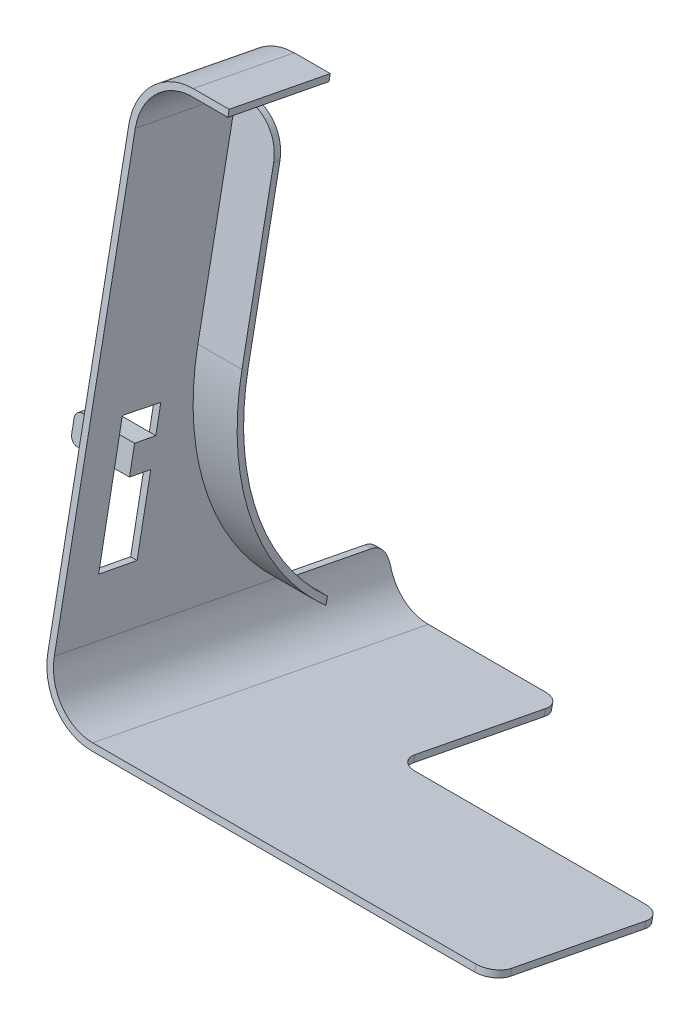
ISO-10303-21;
HEADER;
FILE_DESCRIPTION(('STEP AP214'),'2;1');
FILE_NAME('part.step','',(''),(''),'','','');
FILE_SCHEMA(('AUTOMOTIVE_DESIGN { 1 0 10303 214 1 1 1 1 }'));
ENDSEC;
DATA;
#1=APPLICATION_CONTEXT('core data for automotive mechanical design processes');
#2=APPLICATION_PROTOCOL_DEFINITION('international standard','automotive_design',2000,#1);
#3=PRODUCT_CONTEXT('',#1,'mechanical');
#4=PRODUCT('Part','Part','',(#3));
#5=PRODUCT_RELATED_PRODUCT_CATEGORY('part','',(#4));
#6=PRODUCT_DEFINITION_FORMATION('','',#4);
#7=PRODUCT_DEFINITION_CONTEXT('part definition',#1,'design');
#8=PRODUCT_DEFINITION('design','',#6,#7);
#9=PRODUCT_DEFINITION_SHAPE('','',#8);
#10=(LENGTH_UNIT() NAMED_UNIT(*) SI_UNIT(.MILLI.,.METRE.));
#11=(NAMED_UNIT(*) PLANE_ANGLE_UNIT() SI_UNIT($,.RADIAN.));
#12=(NAMED_UNIT(*) SI_UNIT($,.STERADIAN.) SOLID_ANGLE_UNIT());
#13=UNCERTAINTY_MEASURE_WITH_UNIT(LENGTH_MEASURE(1.E-05),#10,'distance_accuracy_value','');
#14=(GEOMETRIC_REPRESENTATION_CONTEXT(3) GLOBAL_UNCERTAINTY_ASSIGNED_CONTEXT((#13)) GLOBAL_UNIT_ASSIGNED_CONTEXT((#10,
#11,#12)) REPRESENTATION_CONTEXT('',''));
#15=CARTESIAN_POINT('',(0.,0.,0.));
#16=DIRECTION('',(0.,0.,1.));
#17=DIRECTION('',(1.,0.,0.));
#18=AXIS2_PLACEMENT_3D('',#15,#16,#17);
#19=CARTESIAN_POINT('',(-909.843190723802,-455.174766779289,-403.034438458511));
#20=DIRECTION('',(0.,-0.190808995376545,-0.981627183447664));
#21=DIRECTION('',(0.,0.981627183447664,-0.190808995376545));
#22=AXIS2_PLACEMENT_3D('',#19,#20,#21);
#23=PLANE('',#22);
#24=DIRECTION('',(0.,0.981627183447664,-0.190808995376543));
#25=VECTOR('',#24,1.);
#26=CARTESIAN_POINT('',(-892.063190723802,-455.174766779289,-403.034438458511));
#27=LINE('',#26,#25);
#28=CARTESIAN_POINT('',(-892.063190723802,-455.174766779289,-403.034438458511));
#29=VERTEX_POINT('',#28);
#30=CARTESIAN_POINT('',(-892.063190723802,-397.557184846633,-414.234161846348));
#31=VERTEX_POINT('',#30);
#32=EDGE_CURVE('E225',#29,#31,#27,.T.);
#33=ORIENTED_EDGE('',*,*,#32,.F.);
#34=DIRECTION('',(1.,0.,0.));
#35=VECTOR('',#34,1.);
#36=CARTESIAN_POINT('',(-909.843190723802,-455.174766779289,-403.034438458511));
#37=LINE('',#36,#35);
#38=CARTESIAN_POINT('',(-909.843190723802,-455.174766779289,-403.034438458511));
#39=VERTEX_POINT('',#38);
#40=EDGE_CURVE('E232',#29,#39,#37,.F.);
#41=ORIENTED_EDGE('',*,*,#40,.T.);
#42=DIRECTION('',(0.,0.981627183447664,-0.190808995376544));
#43=VECTOR('',#42,1.);
#44=CARTESIAN_POINT('',(-909.843190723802,-455.174766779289,-403.034438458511));
#45=LINE('',#44,#43);
#46=CARTESIAN_POINT('',(-909.843190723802,-385.090519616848,-416.65743608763));
#47=VERTEX_POINT('',#46);
#48=EDGE_CURVE('E246',#39,#47,#45,.T.);
#49=ORIENTED_EDGE('',*,*,#48,.T.);
#50=DIRECTION('',(1.,0.,0.));
#51=VECTOR('',#50,1.);
#52=CARTESIAN_POINT('',(-900.953190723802,-385.090519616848,-416.65743608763));
#53=LINE('',#52,#51);
#54=CARTESIAN_POINT('',(-904.763190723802,-385.090519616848,-416.65743608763));
#55=VERTEX_POINT('',#54);
#56=EDGE_CURVE('E228',#47,#55,#53,.T.);
#57=ORIENTED_EDGE('',*,*,#56,.T.);
#58=CARTESIAN_POINT('',(-904.763190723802,-397.557184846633,-414.234161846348));
#59=DIRECTION('',(0.,-0.19080899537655,-0.981627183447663));
#60=DIRECTION('',(0.,0.981627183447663,-0.19080899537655));
#61=AXIS2_PLACEMENT_3D('',#58,#59,#60);
#62=CIRCLE('',#61,12.7);
#63=EDGE_CURVE('E20',#31,#55,#62,.F.);
#64=ORIENTED_EDGE('',*,*,#63,.F.);
#65=EDGE_LOOP('',(#33,#41,#49,#57,#64));
#66=FACE_BOUND('',#65,.T.);
#67=ADVANCED_FACE('F17',(#66),#23,.T.);
#68=CARTESIAN_POINT('',(-892.063190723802,-472.354550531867,-491.416763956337));
#69=DIRECTION('',(-1.,0.,0.));
#70=DIRECTION('',(0.,0.,1.));
#71=AXIS2_PLACEMENT_3D('',#68,#69,#70);
#72=CYLINDRICAL_SURFACE('',#71,90.0365505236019);
#73=CARTESIAN_POINT('',(-892.063190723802,-472.354550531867,-491.416763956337));
#74=DIRECTION('',(-1.,0.,0.));
#75=DIRECTION('',(0.,0.,1.));
#76=AXIS2_PLACEMENT_3D('',#73,#74,#75);
#77=CIRCLE('',#76,90.0365505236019);
#78=CARTESIAN_POINT('',(-892.063190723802,-539.084509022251,-430.970977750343));
#79=VERTEX_POINT('',#78);
#80=EDGE_CURVE('E241',#79,#29,#77,.T.);
#81=ORIENTED_EDGE('',*,*,#80,.F.);
#82=DIRECTION('',(1.,0.,0.));
#83=VECTOR('',#82,1.);
#84=CARTESIAN_POINT('',(-909.843190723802,-539.084509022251,-430.970977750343));
#85=LINE('',#84,#83);
#86=CARTESIAN_POINT('',(-909.843190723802,-539.084509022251,-430.970977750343));
#87=VERTEX_POINT('',#86);
#88=EDGE_CURVE('E336',#87,#79,#85,.T.);
#89=ORIENTED_EDGE('',*,*,#88,.F.);
#90=CARTESIAN_POINT('',(-909.843190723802,-472.354550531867,-491.416763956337));
#91=DIRECTION('',(-1.,0.,0.));
#92=DIRECTION('',(0.,0.,1.));
#93=AXIS2_PLACEMENT_3D('',#90,#91,#92);
#94=CIRCLE('',#93,90.0365505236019);
#95=EDGE_CURVE('E248',#87,#39,#94,.T.);
#96=ORIENTED_EDGE('',*,*,#95,.T.);
#97=ORIENTED_EDGE('',*,*,#40,.F.);
#98=EDGE_LOOP('',(#81,#89,#96,#97));
#99=FACE_BOUND('',#98,.T.);
#100=ADVANCED_FACE('F457',(#99),#72,.F.);
#101=CARTESIAN_POINT('',(-904.763190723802,-397.120995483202,-411.990162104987));
#102=DIRECTION('',(0.,-0.19080899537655,-0.981627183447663));
#103=DIRECTION('',(0.,0.981627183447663,-0.19080899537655));
#104=AXIS2_PLACEMENT_3D('',#101,#102,#103);
#105=CYLINDRICAL_SURFACE('',#104,12.7);
#106=DIRECTION('',(0.,-0.190808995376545,-0.981627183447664));
#107=VECTOR('',#106,1.);
#108=CARTESIAN_POINT('',(-904.763190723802,-389.016223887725,-436.853433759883));
#109=LINE('',#108,#107);
#110=CARTESIAN_POINT('',(-904.763190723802,-384.654330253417,-414.413436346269));
#111=VERTEX_POINT('',#110);
#112=EDGE_CURVE('E294',#55,#111,#109,.F.);
#113=ORIENTED_EDGE('',*,*,#112,.T.);
#114=CARTESIAN_POINT('',(-904.763190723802,-397.120995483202,-411.990162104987));
#115=DIRECTION('',(0.,-0.19080899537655,-0.981627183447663));
#116=DIRECTION('',(0.,0.981627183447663,-0.19080899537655));
#117=AXIS2_PLACEMENT_3D('',#114,#115,#116);
#118=CIRCLE('',#117,12.7);
#119=CARTESIAN_POINT('',(-892.063190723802,-397.120995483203,-411.990162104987));
#120=VERTEX_POINT('',#119);
#121=EDGE_CURVE('E237',#120,#111,#118,.F.);
#122=ORIENTED_EDGE('',*,*,#121,.F.);
#123=DIRECTION('',(0.,0.190808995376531,0.981627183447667));
#124=VECTOR('',#123,1.);
#125=CARTESIAN_POINT('',(-892.063190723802,-397.557184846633,-414.234161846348));
#126=LINE('',#125,#124);
#127=EDGE_CURVE('E234',#31,#120,#126,.T.);
#128=ORIENTED_EDGE('',*,*,#127,.F.);
#129=ORIENTED_EDGE('',*,*,#63,.T.);
#130=EDGE_LOOP('',(#113,#122,#128,#129));
#131=FACE_BOUND('',#130,.T.);
#132=ADVANCED_FACE('F235',(#131),#105,.T.);
#133=CARTESIAN_POINT('',(-925.940851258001,-476.371766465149,-377.97435611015));
#134=DIRECTION('',(0.,-0.185955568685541,-0.982558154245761));
#135=DIRECTION('',(0.,0.982558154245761,-0.185955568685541));
#136=AXIS2_PLACEMENT_3D('',#133,#134,#135);
#137=CYLINDRICAL_SURFACE('',#136,2.54000000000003);
#138=CARTESIAN_POINT('',(-925.940851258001,-476.371766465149,-377.97435611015));
#139=DIRECTION('',(0.,-0.185955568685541,-0.982558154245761));
#140=DIRECTION('',(0.,0.982558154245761,-0.185955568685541));
#141=AXIS2_PLACEMENT_3D('',#138,#139,#140);
#142=CIRCLE('',#141,2.54000000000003);
#143=CARTESIAN_POINT('',(-925.940851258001,-473.876068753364,-378.446683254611));
#144=VERTEX_POINT('',#143);
#145=CARTESIAN_POINT('',(-928.480851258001,-476.371766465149,-377.97435611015));
#146=VERTEX_POINT('',#145);
#147=EDGE_CURVE('E452',#144,#146,#142,.F.);
#148=ORIENTED_EDGE('',*,*,#147,.F.);
#149=DIRECTION('',(0.,-0.185955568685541,-0.982558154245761));
#150=VECTOR('',#149,1.);
#151=CARTESIAN_POINT('',(-925.940851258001,-473.876068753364,-378.446683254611));
#152=LINE('',#151,#150);
#153=CARTESIAN_POINT('',(-925.940851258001,-475.293050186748,-385.933776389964));
#154=VERTEX_POINT('',#153);
#155=EDGE_CURVE('E296',#144,#154,#152,.T.);
#156=ORIENTED_EDGE('',*,*,#155,.T.);
#157=CARTESIAN_POINT('',(-925.940851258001,-477.788747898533,-385.461449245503));
#158=DIRECTION('',(0.,-0.185955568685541,-0.982558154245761));
#159=DIRECTION('',(0.,0.982558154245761,-0.185955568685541));
#160=AXIS2_PLACEMENT_3D('',#157,#158,#159);
#161=CIRCLE('',#160,2.54000000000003);
#162=CARTESIAN_POINT('',(-928.480851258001,-477.788747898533,-385.461449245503));
#163=VERTEX_POINT('',#162);
#164=EDGE_CURVE('E442',#154,#163,#161,.F.);
#165=ORIENTED_EDGE('',*,*,#164,.T.);
#166=DIRECTION('',(0.,0.18595556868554,0.982558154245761));
#167=VECTOR('',#166,1.);
#168=CARTESIAN_POINT('',(-928.480851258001,-477.788747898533,-385.461449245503));
#169=LINE('',#168,#167);
#170=EDGE_CURVE('E231',#163,#146,#169,.T.);
#171=ORIENTED_EDGE('',*,*,#170,.T.);
#172=EDGE_LOOP('',(#148,#156,#165,#171));
#173=FACE_BOUND('',#172,.T.);
#174=ADVANCED_FACE('F1150',(#173),#137,.T.);
#175=CARTESIAN_POINT('',(-928.480851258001,-476.371766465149,-377.97435611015));
#176=DIRECTION('',(1.,0.,0.));
#177=DIRECTION('',(0.,0.,-1.));
#178=AXIS2_PLACEMENT_3D('',#175,#176,#177);
#179=PLANE('',#178);
#180=DIRECTION('',(0.,-0.185955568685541,-0.982558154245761));
#181=VECTOR('',#180,1.);
#182=CARTESIAN_POINT('',(-928.480851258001,-480.834351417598,-377.1297826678));
#183=LINE('',#182,#181);
#184=CARTESIAN_POINT('',(-928.480851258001,-480.834351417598,-377.1297826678));
#185=VERTEX_POINT('',#184);
#186=CARTESIAN_POINT('',(-928.480851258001,-482.251332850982,-384.616875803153));
#187=VERTEX_POINT('',#186);
#188=EDGE_CURVE('E291',#185,#187,#183,.T.);
#189=ORIENTED_EDGE('',*,*,#188,.F.);
#190=DIRECTION('',(0.,-0.982558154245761,0.185955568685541));
#191=VECTOR('',#190,1.);
#192=CARTESIAN_POINT('',(-928.480851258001,-476.371766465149,-377.97435611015));
#193=LINE('',#192,#191);
#194=EDGE_CURVE('E451',#146,#185,#193,.T.);
#195=ORIENTED_EDGE('',*,*,#194,.F.);
#196=ORIENTED_EDGE('',*,*,#170,.F.);
#197=DIRECTION('',(0.,-0.982558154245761,0.185955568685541));
#198=VECTOR('',#197,1.);
#199=CARTESIAN_POINT('',(-928.480851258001,-477.788747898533,-385.461449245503));
#200=LINE('',#199,#198);
#201=EDGE_CURVE('E441',#163,#187,#200,.T.);
#202=ORIENTED_EDGE('',*,*,#201,.T.);
#203=EDGE_LOOP('',(#189,#195,#196,#202));
#204=FACE_BOUND('',#203,.T.);
#205=ADVANCED_FACE('F1140',(#204),#179,.F.);
#206=CARTESIAN_POINT('',(-925.940851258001,-480.834351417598,-377.1297826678));
#207=DIRECTION('',(0.,-0.185955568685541,-0.982558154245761));
#208=DIRECTION('',(0.,0.982558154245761,-0.185955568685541));
#209=AXIS2_PLACEMENT_3D('',#206,#207,#208);
#210=CYLINDRICAL_SURFACE('',#209,2.54000000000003);
#211=CARTESIAN_POINT('',(-925.940851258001,-480.834351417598,-377.1297826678));
#212=DIRECTION('',(0.,-0.185955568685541,-0.982558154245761));
#213=DIRECTION('',(0.,0.982558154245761,-0.185955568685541));
#214=AXIS2_PLACEMENT_3D('',#211,#212,#213);
#215=CIRCLE('',#214,2.54000000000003);
#216=CARTESIAN_POINT('',(-925.940851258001,-483.330049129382,-376.657455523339));
#217=VERTEX_POINT('',#216);
#218=EDGE_CURVE('E448',#185,#217,#215,.F.);
#219=ORIENTED_EDGE('',*,*,#218,.F.);
#220=ORIENTED_EDGE('',*,*,#188,.T.);
#221=CARTESIAN_POINT('',(-925.940851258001,-482.251332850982,-384.616875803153));
#222=DIRECTION('',(0.,-0.185955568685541,-0.982558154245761));
#223=DIRECTION('',(0.,0.982558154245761,-0.185955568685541));
#224=AXIS2_PLACEMENT_3D('',#221,#222,#223);
#225=CIRCLE('',#224,2.54000000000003);
#226=CARTESIAN_POINT('',(-925.940851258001,-484.747030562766,-384.144548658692));
#227=VERTEX_POINT('',#226);
#228=EDGE_CURVE('E439',#187,#227,#225,.F.);
#229=ORIENTED_EDGE('',*,*,#228,.T.);
#230=DIRECTION('',(0.,0.185955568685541,0.982558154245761));
#231=VECTOR('',#230,1.);
#232=CARTESIAN_POINT('',(-925.940851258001,-483.330049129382,-376.657455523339));
#233=LINE('',#232,#231);
#234=EDGE_CURVE('E268',#227,#217,#233,.T.);
#235=ORIENTED_EDGE('',*,*,#234,.T.);
#236=EDGE_LOOP('',(#219,#220,#229,#235));
#237=FACE_BOUND('',#236,.T.);
#238=ADVANCED_FACE('F1130',(#237),#210,.T.);
#239=CARTESIAN_POINT('',(-920.207395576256,-478.811174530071,-377.512682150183));
#240=DIRECTION('',(0.,-0.185955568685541,-0.982558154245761));
#241=DIRECTION('',(0.,0.982558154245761,-0.185955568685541));
#242=AXIS2_PLACEMENT_3D('',#239,#240,#241);
#243=CYLINDRICAL_SURFACE('',#242,2.90282534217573);
#244=CARTESIAN_POINT('',(-920.207395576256,-480.228155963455,-384.999775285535));
#245=DIRECTION('',(0.,-0.185955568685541,-0.982558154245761));
#246=DIRECTION('',(0.,0.982558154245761,-0.185955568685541));
#247=AXIS2_PLACEMENT_3D('',#244,#245,#246);
#248=CIRCLE('',#247,2.90282534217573);
#249=CARTESIAN_POINT('',(-920.207395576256,-477.375961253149,-385.539571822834));
#250=VERTEX_POINT('',#249);
#251=EDGE_CURVE('E435',#250,#250,#248,.T.);
#252=ORIENTED_EDGE('',*,*,#251,.T.);
#253=EDGE_LOOP('',(#252));
#254=FACE_BOUND('',#253,.T.);
#255=CARTESIAN_POINT('',(-920.207395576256,-478.811174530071,-377.512682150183));
#256=DIRECTION('',(0.,-0.185955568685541,-0.982558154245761));
#257=DIRECTION('',(0.,0.982558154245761,-0.185955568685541));
#258=AXIS2_PLACEMENT_3D('',#255,#256,#257);
#259=CIRCLE('',#258,2.90282534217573);
#260=CARTESIAN_POINT('',(-920.207395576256,-475.958979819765,-378.052478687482));
#261=VERTEX_POINT('',#260);
#262=EDGE_CURVE('E271',#261,#261,#259,.T.);
#263=ORIENTED_EDGE('',*,*,#262,.F.);
#264=EDGE_LOOP('',(#263));
#265=FACE_BOUND('',#264,.T.);
#266=ADVANCED_FACE('F1121',(#254,#265),#243,.F.);
#267=CARTESIAN_POINT('',(-900.953190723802,-389.016223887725,-436.853433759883));
#268=DIRECTION('',(0.,-0.981627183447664,0.190808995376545));
#269=DIRECTION('',(0.,-0.190808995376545,-0.981627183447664));
#270=AXIS2_PLACEMENT_3D('',#267,#268,#269);
#271=PLANE('',#270);
#272=DIRECTION('',(0.,0.190808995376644,0.981627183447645));
#273=VECTOR('',#272,1.);
#274=CARTESIAN_POINT('',(-909.843190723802,-385.090519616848,-416.65743608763));
#275=LINE('',#274,#273);
#276=CARTESIAN_POINT('',(-909.843190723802,-384.654330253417,-414.413436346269));
#277=VERTEX_POINT('',#276);
#278=EDGE_CURVE('E263',#47,#277,#275,.T.);
#279=ORIENTED_EDGE('',*,*,#278,.T.);
#280=DIRECTION('',(1.,0.,0.));
#281=VECTOR('',#280,1.);
#282=CARTESIAN_POINT('',(-1005.13315255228,-384.654330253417,-414.413436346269));
#283=LINE('',#282,#281);
#284=CARTESIAN_POINT('',(-907.597152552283,-384.654330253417,-414.413436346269));
#285=VERTEX_POINT('',#284);
#286=EDGE_CURVE('E259',#277,#285,#283,.T.);
#287=ORIENTED_EDGE('',*,*,#286,.T.);
#288=DIRECTION('',(1.,0.,0.));
#289=VECTOR('',#288,1.);
#290=CARTESIAN_POINT('',(-909.843190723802,-384.654330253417,-414.413436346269));
#291=LINE('',#290,#289);
#292=EDGE_CURVE('E445',#111,#285,#291,.F.);
#293=ORIENTED_EDGE('',*,*,#292,.F.);
#294=ORIENTED_EDGE('',*,*,#112,.F.);
#295=ORIENTED_EDGE('',*,*,#56,.F.);
#296=EDGE_LOOP('',(#279,#287,#293,#294,#295));
#297=FACE_BOUND('',#296,.T.);
#298=ADVANCED_FACE('F466',(#297),#271,.F.);
#299=CARTESIAN_POINT('',(-909.843190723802,-465.750568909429,-414.203970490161));
#300=DIRECTION('',(1.,0.,0.));
#301=DIRECTION('',(0.,0.,-1.));
#302=AXIS2_PLACEMENT_3D('',#299,#300,#301);
#303=PLANE('',#302);
#304=ORIENTED_EDGE('',*,*,#95,.F.);
#305=DIRECTION('',(0.,0.981627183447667,-0.190808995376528));
#306=VECTOR('',#305,1.);
#307=CARTESIAN_POINT('',(-909.843190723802,-541.69537613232,-430.46347659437));
#308=LINE('',#307,#306);
#309=CARTESIAN_POINT('',(-909.843190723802,-541.695376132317,-430.463476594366));
#310=VERTEX_POINT('',#309);
#311=EDGE_CURVE('E339',#310,#87,#308,.T.);
#312=ORIENTED_EDGE('',*,*,#311,.F.);
#313=CARTESIAN_POINT('',(-909.843190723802,-472.354550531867,-491.416763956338));
#314=DIRECTION('',(-1.,0.,0.));
#315=DIRECTION('',(0.,0.,1.));
#316=AXIS2_PLACEMENT_3D('',#313,#314,#315);
#317=CIRCLE('',#316,92.3225505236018);
#318=CARTESIAN_POINT('',(-909.843190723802,-454.738577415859,-400.79043871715));
#319=VERTEX_POINT('',#318);
#320=EDGE_CURVE('E432',#310,#319,#317,.T.);
#321=ORIENTED_EDGE('',*,*,#320,.T.);
#322=DIRECTION('',(0.,-0.981627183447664,0.190808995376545));
#323=VECTOR('',#322,1.);
#324=CARTESIAN_POINT('',(-909.843190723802,-365.954332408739,-418.048347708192));
#325=LINE('',#324,#323);
#326=EDGE_CURVE('E256',#319,#277,#325,.F.);
#327=ORIENTED_EDGE('',*,*,#326,.T.);
#328=ORIENTED_EDGE('',*,*,#278,.F.);
#329=ORIENTED_EDGE('',*,*,#48,.F.);
#330=EDGE_LOOP('',(#304,#312,#321,#327,#328,#329));
#331=FACE_BOUND('',#330,.T.);
#332=ADVANCED_FACE('F462',(#331),#303,.F.);
#333=CARTESIAN_POINT('',(-892.063190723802,-539.084509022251,-430.970977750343));
#334=DIRECTION('',(1.,0.,0.));
#335=DIRECTION('',(0.,0.,-1.));
#336=AXIS2_PLACEMENT_3D('',#333,#334,#335);
#337=PLANE('',#336);
#338=DIRECTION('',(0.,0.981627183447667,-0.190808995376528));
#339=VECTOR('',#338,1.);
#340=CARTESIAN_POINT('',(-892.063190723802,-541.69537613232,-430.46347659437));
#341=LINE('',#340,#339);
#342=CARTESIAN_POINT('',(-892.063190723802,-541.69537613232,-430.46347659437));
#343=VERTEX_POINT('',#342);
#344=EDGE_CURVE('E251',#79,#343,#341,.F.);
#345=ORIENTED_EDGE('',*,*,#344,.F.);
#346=ORIENTED_EDGE('',*,*,#80,.T.);
#347=ORIENTED_EDGE('',*,*,#32,.T.);
#348=ORIENTED_EDGE('',*,*,#127,.T.);
#349=DIRECTION('',(0.,-0.981627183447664,0.190808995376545));
#350=VECTOR('',#349,1.);
#351=CARTESIAN_POINT('',(-892.063190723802,-365.954332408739,-418.048347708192));
#352=LINE('',#351,#350);
#353=CARTESIAN_POINT('',(-892.063190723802,-454.738577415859,-400.79043871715));
#354=VERTEX_POINT('',#353);
#355=EDGE_CURVE('E622',#354,#120,#352,.F.);
#356=ORIENTED_EDGE('',*,*,#355,.F.);
#357=CARTESIAN_POINT('',(-892.063190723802,-472.354550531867,-491.416763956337));
#358=DIRECTION('',(-1.,0.,0.));
#359=DIRECTION('',(0.,0.,1.));
#360=AXIS2_PLACEMENT_3D('',#357,#358,#359);
#361=CIRCLE('',#360,92.3225505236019);
#362=EDGE_CURVE('E429',#343,#354,#361,.T.);
#363=ORIENTED_EDGE('',*,*,#362,.F.);
#364=EDGE_LOOP('',(#345,#346,#347,#348,#356,#363));
#365=FACE_BOUND('',#364,.T.);
#366=ADVANCED_FACE('F244',(#365),#337,.T.);
#367=CARTESIAN_POINT('',(-909.843190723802,-541.69537613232,-430.46347659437));
#368=DIRECTION('',(0.,-0.190808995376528,-0.981627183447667));
#369=DIRECTION('',(0.,0.981627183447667,-0.190808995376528));
#370=AXIS2_PLACEMENT_3D('',#367,#368,#369);
#371=PLANE('',#370);
#372=DIRECTION('',(-1.,0.,0.));
#373=VECTOR('',#372,1.);
#374=CARTESIAN_POINT('',(-892.063190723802,-541.69537613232,-430.46347659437));
#375=LINE('',#374,#373);
#376=CARTESIAN_POINT('',(-907.551727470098,-541.69537613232,-430.46347659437));
#377=VERTEX_POINT('',#376);
#378=EDGE_CURVE('E431',#377,#343,#375,.F.);
#379=ORIENTED_EDGE('',*,*,#378,.F.);
#380=DIRECTION('',(1.,0.,0.));
#381=VECTOR('',#380,1.);
#382=CARTESIAN_POINT('',(-1005.13315255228,-541.69537613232,-430.46347659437));
#383=LINE('',#382,#381);
#384=EDGE_CURVE('E600',#377,#310,#383,.F.);
#385=ORIENTED_EDGE('',*,*,#384,.T.);
#386=ORIENTED_EDGE('',*,*,#311,.T.);
#387=ORIENTED_EDGE('',*,*,#88,.T.);
#388=ORIENTED_EDGE('',*,*,#344,.T.);
#389=EDGE_LOOP('',(#379,#385,#386,#387,#388));
#390=FACE_BOUND('',#389,.T.);
#391=ADVANCED_FACE('F643',(#390),#371,.T.);
#392=CARTESIAN_POINT('',(-907.597152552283,-473.876068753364,-378.446683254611));
#393=DIRECTION('',(0.,-0.982558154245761,0.185955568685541));
#394=DIRECTION('',(0.,-0.185955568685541,-0.982558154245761));
#395=AXIS2_PLACEMENT_3D('',#392,#393,#394);
#396=PLANE('',#395);
#397=DIRECTION('',(1.,0.,0.));
#398=VECTOR('',#397,1.);
#399=CARTESIAN_POINT('',(-925.940851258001,-475.293050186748,-385.933776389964));
#400=LINE('',#399,#398);
#401=CARTESIAN_POINT('',(-909.883152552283,-475.293050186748,-385.933776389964));
#402=VERTEX_POINT('',#401);
#403=EDGE_CURVE('E275',#402,#154,#400,.F.);
#404=ORIENTED_EDGE('',*,*,#403,.T.);
#405=ORIENTED_EDGE('',*,*,#155,.F.);
#406=DIRECTION('',(1.,0.,0.));
#407=VECTOR('',#406,1.);
#408=CARTESIAN_POINT('',(-925.940851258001,-473.876068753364,-378.446683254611));
#409=LINE('',#408,#407);
#410=CARTESIAN_POINT('',(-907.597152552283,-473.876068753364,-378.446683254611));
#411=VERTEX_POINT('',#410);
#412=EDGE_CURVE('E298',#411,#144,#409,.F.);
#413=ORIENTED_EDGE('',*,*,#412,.F.);
#414=DIRECTION('',(0.,0.185955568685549,0.98255815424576));
#415=VECTOR('',#414,1.);
#416=CARTESIAN_POINT('',(-907.597152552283,-475.293050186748,-385.933776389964));
#417=LINE('',#416,#415);
#418=CARTESIAN_POINT('',(-907.597152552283,-475.293050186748,-385.933776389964));
#419=VERTEX_POINT('',#418);
#420=EDGE_CURVE('E328',#419,#411,#417,.T.);
#421=ORIENTED_EDGE('',*,*,#420,.F.);
#422=DIRECTION('',(1.,0.,0.));
#423=VECTOR('',#422,1.);
#424=CARTESIAN_POINT('',(-749.228152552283,-475.293050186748,-385.933776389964));
#425=LINE('',#424,#423);
#426=EDGE_CURVE('E260',#419,#402,#425,.F.);
#427=ORIENTED_EDGE('',*,*,#426,.T.);
#428=EDGE_LOOP('',(#404,#405,#413,#421,#427));
#429=FACE_BOUND('',#428,.T.);
#430=ADVANCED_FACE('F1078',(#429),#396,.F.);
#431=CARTESIAN_POINT('',(-925.940851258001,-476.371766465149,-377.97435611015));
#432=DIRECTION('',(0.,0.185955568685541,0.982558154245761));
#433=DIRECTION('',(0.,-0.982558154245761,0.185955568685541));
#434=AXIS2_PLACEMENT_3D('',#431,#432,#433);
#435=PLANE('',#434);
#436=ORIENTED_EDGE('',*,*,#262,.T.);
#437=EDGE_LOOP('',(#436));
#438=FACE_BOUND('',#437,.T.);
#439=ORIENTED_EDGE('',*,*,#194,.T.);
#440=ORIENTED_EDGE('',*,*,#218,.T.);
#441=DIRECTION('',(1.,0.,0.));
#442=VECTOR('',#441,1.);
#443=CARTESIAN_POINT('',(-925.940851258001,-483.330049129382,-376.657455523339));
#444=LINE('',#443,#442);
#445=CARTESIAN_POINT('',(-907.597152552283,-483.330049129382,-376.657455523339));
#446=VERTEX_POINT('',#445);
#447=EDGE_CURVE('E270',#217,#446,#444,.T.);
#448=ORIENTED_EDGE('',*,*,#447,.T.);
#449=DIRECTION('',(0.,-0.982558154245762,0.185955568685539));
#450=VECTOR('',#449,1.);
#451=CARTESIAN_POINT('',(-907.597152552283,-473.876068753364,-378.446683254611));
#452=LINE('',#451,#450);
#453=EDGE_CURVE('E318',#411,#446,#452,.T.);
#454=ORIENTED_EDGE('',*,*,#453,.F.);
#455=ORIENTED_EDGE('',*,*,#412,.T.);
#456=ORIENTED_EDGE('',*,*,#147,.T.);
#457=EDGE_LOOP('',(#439,#440,#448,#454,#455,#456));
#458=FACE_BOUND('',#457,.T.);
#459=ADVANCED_FACE('F1068',(#438,#458),#435,.T.);
#460=CARTESIAN_POINT('',(-925.940851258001,-483.330049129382,-376.657455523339));
#461=DIRECTION('',(0.,0.982558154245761,-0.185955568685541));
#462=DIRECTION('',(0.,0.185955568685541,0.982558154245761));
#463=AXIS2_PLACEMENT_3D('',#460,#461,#462);
#464=PLANE('',#463);
#465=DIRECTION('',(1.,0.,0.));
#466=VECTOR('',#465,1.);
#467=CARTESIAN_POINT('',(-749.228152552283,-484.747030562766,-384.144548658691));
#468=LINE('',#467,#466);
#469=CARTESIAN_POINT('',(-909.883152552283,-484.747030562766,-384.144548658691));
#470=VERTEX_POINT('',#469);
#471=CARTESIAN_POINT('',(-907.597152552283,-484.747030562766,-384.144548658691));
#472=VERTEX_POINT('',#471);
#473=EDGE_CURVE('E272',#470,#472,#468,.T.);
#474=ORIENTED_EDGE('',*,*,#473,.T.);
#475=DIRECTION('',(0.,-0.185955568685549,-0.98255815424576));
#476=VECTOR('',#475,1.);
#477=CARTESIAN_POINT('',(-907.597152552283,-483.330049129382,-376.657455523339));
#478=LINE('',#477,#476);
#479=EDGE_CURVE('E313',#446,#472,#478,.T.);
#480=ORIENTED_EDGE('',*,*,#479,.F.);
#481=ORIENTED_EDGE('',*,*,#447,.F.);
#482=ORIENTED_EDGE('',*,*,#234,.F.);
#483=DIRECTION('',(1.,0.,0.));
#484=VECTOR('',#483,1.);
#485=CARTESIAN_POINT('',(-925.940851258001,-484.747030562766,-384.144548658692));
#486=LINE('',#485,#484);
#487=EDGE_CURVE('E438',#227,#470,#486,.T.);
#488=ORIENTED_EDGE('',*,*,#487,.T.);
#489=EDGE_LOOP('',(#474,#480,#481,#482,#488));
#490=FACE_BOUND('',#489,.T.);
#491=ADVANCED_FACE('F1059',(#490),#464,.F.);
#492=CARTESIAN_POINT('',(-909.843190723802,-365.954332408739,-418.048347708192));
#493=DIRECTION('',(0.,0.190808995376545,0.981627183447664));
#494=DIRECTION('',(0.,-0.981627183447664,0.190808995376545));
#495=AXIS2_PLACEMENT_3D('',#492,#493,#494);
#496=PLANE('',#495);
#497=DIRECTION('',(1.,0.,0.));
#498=VECTOR('',#497,1.);
#499=CARTESIAN_POINT('',(-909.843190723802,-454.738577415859,-400.79043871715));
#500=LINE('',#499,#498);
#501=CARTESIAN_POINT('',(-907.597152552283,-454.738577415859,-400.79043871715));
#502=VERTEX_POINT('',#501);
#503=EDGE_CURVE('E633',#502,#354,#500,.T.);
#504=ORIENTED_EDGE('',*,*,#503,.T.);
#505=ORIENTED_EDGE('',*,*,#355,.T.);
#506=ORIENTED_EDGE('',*,*,#121,.T.);
#507=ORIENTED_EDGE('',*,*,#292,.T.);
#508=DIRECTION('',(0.,0.981627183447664,-0.190808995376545));
#509=VECTOR('',#508,1.);
#510=CARTESIAN_POINT('',(-907.597152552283,-454.738577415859,-400.79043871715));
#511=LINE('',#510,#509);
#512=EDGE_CURVE('E570',#502,#285,#511,.T.);
#513=ORIENTED_EDGE('',*,*,#512,.F.);
#514=EDGE_LOOP('',(#504,#505,#506,#507,#513));
#515=FACE_BOUND('',#514,.T.);
#516=ADVANCED_FACE('F1049',(#515),#496,.T.);
#517=CARTESIAN_POINT('',(-749.228152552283,-463.226576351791,-374.138966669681));
#518=DIRECTION('',(0.,0.979892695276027,-0.199525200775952));
#519=DIRECTION('',(0.,0.199525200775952,0.979892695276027));
#520=AXIS2_PLACEMENT_3D('',#517,#518,#519);
#521=PLANE('',#520);
#522=DIRECTION('',(1.,0.,0.));
#523=VECTOR('',#522,1.);
#524=CARTESIAN_POINT('',(-749.228152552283,-463.226576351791,-374.138966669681));
#525=LINE('',#524,#523);
#526=CARTESIAN_POINT('',(-907.597152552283,-463.226576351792,-374.138966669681));
#527=VERTEX_POINT('',#526);
#528=CARTESIAN_POINT('',(-909.883152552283,-463.226576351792,-374.138966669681));
#529=VERTEX_POINT('',#528);
#530=EDGE_CURVE('E620',#527,#529,#525,.F.);
#531=ORIENTED_EDGE('',*,*,#530,.T.);
#532=DIRECTION('',(0.,0.199525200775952,0.979892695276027));
#533=VECTOR('',#532,1.);
#534=CARTESIAN_POINT('',(-909.883152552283,-465.986855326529,-387.69503474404));
#535=LINE('',#534,#533);
#536=CARTESIAN_POINT('',(-909.883152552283,-465.986855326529,-387.69503474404));
#537=VERTEX_POINT('',#536);
#538=EDGE_CURVE('E533',#537,#529,#535,.T.);
#539=ORIENTED_EDGE('',*,*,#538,.F.);
#540=DIRECTION('',(1.,0.,0.));
#541=VECTOR('',#540,1.);
#542=CARTESIAN_POINT('',(-749.228152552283,-465.986855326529,-387.69503474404));
#543=LINE('',#542,#541);
#544=CARTESIAN_POINT('',(-907.597152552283,-465.986855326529,-387.69503474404));
#545=VERTEX_POINT('',#544);
#546=EDGE_CURVE('E301',#537,#545,#543,.T.);
#547=ORIENTED_EDGE('',*,*,#546,.T.);
#548=DIRECTION('',(0.,-0.199525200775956,-0.979892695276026));
#549=VECTOR('',#548,1.);
#550=CARTESIAN_POINT('',(-907.597152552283,-463.226576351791,-374.138966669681));
#551=LINE('',#550,#549);
#552=EDGE_CURVE('E579',#527,#545,#551,.T.);
#553=ORIENTED_EDGE('',*,*,#552,.F.);
#554=EDGE_LOOP('',(#531,#539,#547,#553));
#555=FACE_BOUND('',#554,.T.);
#556=ADVANCED_FACE('F1039',(#555),#521,.F.);
#557=CARTESIAN_POINT('',(-749.228152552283,-507.559879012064,-365.748598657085));
#558=DIRECTION('',(0.,0.185955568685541,0.982558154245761));
#559=DIRECTION('',(0.,-0.982558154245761,0.185955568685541));
#560=AXIS2_PLACEMENT_3D('',#557,#558,#559);
#561=PLANE('',#560);
#562=DIRECTION('',(1.,0.,0.));
#563=VECTOR('',#562,1.);
#564=CARTESIAN_POINT('',(-749.228152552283,-507.559879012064,-365.748598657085));
#565=LINE('',#564,#563);
#566=CARTESIAN_POINT('',(-907.597152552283,-507.559879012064,-365.748598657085));
#567=VERTEX_POINT('',#566);
#568=CARTESIAN_POINT('',(-909.883152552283,-507.559879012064,-365.748598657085));
#569=VERTEX_POINT('',#568);
#570=EDGE_CURVE('E522',#567,#569,#565,.F.);
#571=ORIENTED_EDGE('',*,*,#570,.T.);
#572=DIRECTION('',(0.,-0.982558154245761,0.185955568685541));
#573=VECTOR('',#572,1.);
#574=CARTESIAN_POINT('',(-909.883152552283,-463.226576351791,-374.138966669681));
#575=LINE('',#574,#573);
#576=EDGE_CURVE('E531',#529,#569,#575,.T.);
#577=ORIENTED_EDGE('',*,*,#576,.F.);
#578=ORIENTED_EDGE('',*,*,#530,.F.);
#579=DIRECTION('',(0.,0.982558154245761,-0.185955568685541));
#580=VECTOR('',#579,1.);
#581=CARTESIAN_POINT('',(-907.597152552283,-507.559879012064,-365.748598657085));
#582=LINE('',#581,#580);
#583=EDGE_CURVE('E573',#567,#527,#582,.T.);
#584=ORIENTED_EDGE('',*,*,#583,.F.);
#585=EDGE_LOOP('',(#571,#577,#578,#584));
#586=FACE_BOUND('',#585,.T.);
#587=ADVANCED_FACE('F1030',(#586),#561,.F.);
#588=CARTESIAN_POINT('',(-749.228152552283,-507.559879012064,-365.748598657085));
#589=DIRECTION('',(0.,-0.982558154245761,0.185955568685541));
#590=DIRECTION('',(0.,-0.185955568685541,-0.982558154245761));
#591=AXIS2_PLACEMENT_3D('',#588,#589,#590);
#592=PLANE('',#591);
#593=DIRECTION('',(1.,0.,0.));
#594=VECTOR('',#593,1.);
#595=CARTESIAN_POINT('',(-749.228152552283,-510.132186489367,-379.340241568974));
#596=LINE('',#595,#594);
#597=CARTESIAN_POINT('',(-907.597152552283,-510.132186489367,-379.340241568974));
#598=VERTEX_POINT('',#597);
#599=CARTESIAN_POINT('',(-909.883152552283,-510.132186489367,-379.340241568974));
#600=VERTEX_POINT('',#599);
#601=EDGE_CURVE('E276',#598,#600,#596,.F.);
#602=ORIENTED_EDGE('',*,*,#601,.T.);
#603=DIRECTION('',(0.,-0.185955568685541,-0.982558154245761));
#604=VECTOR('',#603,1.);
#605=CARTESIAN_POINT('',(-909.883152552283,-507.559879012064,-365.748598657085));
#606=LINE('',#605,#604);
#607=EDGE_CURVE('E288',#569,#600,#606,.T.);
#608=ORIENTED_EDGE('',*,*,#607,.F.);
#609=ORIENTED_EDGE('',*,*,#570,.F.);
#610=DIRECTION('',(0.,0.185955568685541,0.982558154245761));
#611=VECTOR('',#610,1.);
#612=CARTESIAN_POINT('',(-907.597152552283,-510.132186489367,-379.340241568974));
#613=LINE('',#612,#611);
#614=EDGE_CURVE('E312',#598,#567,#613,.T.);
#615=ORIENTED_EDGE('',*,*,#614,.F.);
#616=EDGE_LOOP('',(#602,#608,#609,#615));
#617=FACE_BOUND('',#616,.T.);
#618=ADVANCED_FACE('F516',(#617),#592,.F.);
#619=CARTESIAN_POINT('',(-749.228152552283,-510.132186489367,-379.340241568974));
#620=DIRECTION('',(0.,-0.185955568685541,-0.982558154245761));
#621=DIRECTION('',(0.,0.982558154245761,-0.185955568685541));
#622=AXIS2_PLACEMENT_3D('',#619,#620,#621);
#623=PLANE('',#622);
#624=DIRECTION('',(0.,0.982558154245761,-0.185955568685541));
#625=VECTOR('',#624,1.);
#626=CARTESIAN_POINT('',(-909.883152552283,-510.132186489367,-379.340241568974));
#627=LINE('',#626,#625);
#628=EDGE_CURVE('E283',#600,#470,#627,.T.);
#629=ORIENTED_EDGE('',*,*,#628,.F.);
#630=ORIENTED_EDGE('',*,*,#601,.F.);
#631=DIRECTION('',(0.,-0.982558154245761,0.185955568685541));
#632=VECTOR('',#631,1.);
#633=CARTESIAN_POINT('',(-907.597152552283,-484.747030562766,-384.144548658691));
#634=LINE('',#633,#632);
#635=EDGE_CURVE('E309',#472,#598,#634,.T.);
#636=ORIENTED_EDGE('',*,*,#635,.F.);
#637=ORIENTED_EDGE('',*,*,#473,.F.);
#638=EDGE_LOOP('',(#629,#630,#636,#637));
#639=FACE_BOUND('',#638,.T.);
#640=ADVANCED_FACE('F525',(#639),#623,.F.);
#641=CARTESIAN_POINT('',(-925.940851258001,-477.788747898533,-385.461449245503));
#642=DIRECTION('',(0.,0.185955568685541,0.982558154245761));
#643=DIRECTION('',(0.,-0.982558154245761,0.185955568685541));
#644=AXIS2_PLACEMENT_3D('',#641,#642,#643);
#645=PLANE('',#644);
#646=ORIENTED_EDGE('',*,*,#251,.F.);
#647=EDGE_LOOP('',(#646));
#648=FACE_BOUND('',#647,.T.);
#649=ORIENTED_EDGE('',*,*,#487,.F.);
#650=ORIENTED_EDGE('',*,*,#228,.F.);
#651=ORIENTED_EDGE('',*,*,#201,.F.);
#652=ORIENTED_EDGE('',*,*,#164,.F.);
#653=ORIENTED_EDGE('',*,*,#403,.F.);
#654=DIRECTION('',(0.,0.982558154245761,-0.185955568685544));
#655=VECTOR('',#654,1.);
#656=CARTESIAN_POINT('',(-909.883152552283,-484.747030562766,-384.144548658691));
#657=LINE('',#656,#655);
#658=EDGE_CURVE('E279',#470,#402,#657,.T.);
#659=ORIENTED_EDGE('',*,*,#658,.F.);
#660=EDGE_LOOP('',(#649,#650,#651,#652,#653,#659));
#661=FACE_BOUND('',#660,.T.);
#662=ADVANCED_FACE('F1003',(#648,#661),#645,.F.);
#663=CARTESIAN_POINT('',(-749.228152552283,-510.132186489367,-379.340241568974));
#664=DIRECTION('',(0.,-0.185955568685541,-0.982558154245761));
#665=DIRECTION('',(0.,0.982558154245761,-0.185955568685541));
#666=AXIS2_PLACEMENT_3D('',#663,#664,#665);
#667=PLANE('',#666);
#668=DIRECTION('',(0.,-0.982558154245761,0.185955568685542));
#669=VECTOR('',#668,1.);
#670=CARTESIAN_POINT('',(-907.597152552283,-465.986855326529,-387.69503474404));
#671=LINE('',#670,#669);
#672=EDGE_CURVE('E333',#545,#419,#671,.T.);
#673=ORIENTED_EDGE('',*,*,#672,.F.);
#674=ORIENTED_EDGE('',*,*,#546,.F.);
#675=DIRECTION('',(0.,0.982558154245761,-0.185955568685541));
#676=VECTOR('',#675,1.);
#677=CARTESIAN_POINT('',(-909.883152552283,-475.293050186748,-385.933776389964));
#678=LINE('',#677,#676);
#679=EDGE_CURVE('E282',#402,#537,#678,.T.);
#680=ORIENTED_EDGE('',*,*,#679,.F.);
#681=ORIENTED_EDGE('',*,*,#426,.F.);
#682=EDGE_LOOP('',(#673,#674,#680,#681));
#683=FACE_BOUND('',#682,.T.);
#684=ADVANCED_FACE('F994',(#683),#667,.F.);
#685=CARTESIAN_POINT('',(-1005.13315255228,-365.954332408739,-418.048347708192));
#686=DIRECTION('',(0.,0.190808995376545,0.981627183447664));
#687=DIRECTION('',(0.,-0.981627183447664,0.190808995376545));
#688=AXIS2_PLACEMENT_3D('',#685,#686,#687);
#689=PLANE('',#688);
#690=DIRECTION('',(0.,-0.981627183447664,0.190808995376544));
#691=VECTOR('',#690,1.);
#692=CARTESIAN_POINT('',(-909.883152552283,-384.654330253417,-414.413436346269));
#693=LINE('',#692,#691);
#694=CARTESIAN_POINT('',(-909.883152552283,-384.654330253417,-414.413436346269));
#695=VERTEX_POINT('',#694);
#696=CARTESIAN_POINT('',(-909.883152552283,-454.738577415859,-400.79043871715));
#697=VERTEX_POINT('',#696);
#698=EDGE_CURVE('E536',#695,#697,#693,.T.);
#699=ORIENTED_EDGE('',*,*,#698,.F.);
#700=CARTESIAN_POINT('',(-890.833152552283,-384.654330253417,-414.413436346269));
#701=DIRECTION('',(0.,0.190808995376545,0.981627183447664));
#702=DIRECTION('',(0.,-0.981627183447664,0.190808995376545));
#703=AXIS2_PLACEMENT_3D('',#700,#701,#702);
#704=CIRCLE('',#703,19.05);
#705=CARTESIAN_POINT('',(-890.833152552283,-365.954332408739,-418.048347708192));
#706=VERTEX_POINT('',#705);
#707=EDGE_CURVE('E540',#706,#695,#704,.T.);
#708=ORIENTED_EDGE('',*,*,#707,.F.);
#709=DIRECTION('',(1.,0.,0.));
#710=VECTOR('',#709,1.);
#711=CARTESIAN_POINT('',(-890.833152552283,-365.95433240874,-418.048347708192));
#712=LINE('',#711,#710);
#713=CARTESIAN_POINT('',(-878.133152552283,-365.95433240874,-418.048347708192));
#714=VERTEX_POINT('',#713);
#715=EDGE_CURVE('E546',#714,#706,#712,.F.);
#716=ORIENTED_EDGE('',*,*,#715,.F.);
#717=DIRECTION('',(0.,0.981627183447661,-0.19080899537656));
#718=VECTOR('',#717,1.);
#719=CARTESIAN_POINT('',(-878.133152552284,-368.198332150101,-417.612158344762));
#720=LINE('',#719,#718);
#721=CARTESIAN_POINT('',(-878.133152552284,-368.198332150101,-417.612158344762));
#722=VERTEX_POINT('',#721);
#723=EDGE_CURVE('E550',#722,#714,#720,.T.);
#724=ORIENTED_EDGE('',*,*,#723,.F.);
#725=DIRECTION('',(1.,0.,0.));
#726=VECTOR('',#725,1.);
#727=CARTESIAN_POINT('',(-878.133152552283,-368.198332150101,-417.612158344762));
#728=LINE('',#727,#726);
#729=CARTESIAN_POINT('',(-890.833152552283,-368.198332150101,-417.612158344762));
#730=VERTEX_POINT('',#729);
#731=EDGE_CURVE('E561',#730,#722,#728,.T.);
#732=ORIENTED_EDGE('',*,*,#731,.F.);
#733=CARTESIAN_POINT('',(-890.833152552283,-384.654330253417,-414.413436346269));
#734=DIRECTION('',(0.,0.190808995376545,0.981627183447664));
#735=DIRECTION('',(0.,-0.981627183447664,0.190808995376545));
#736=AXIS2_PLACEMENT_3D('',#733,#734,#735);
#737=CIRCLE('',#736,16.764);
#738=EDGE_CURVE('E569',#730,#285,#737,.T.);
#739=ORIENTED_EDGE('',*,*,#738,.T.);
#740=ORIENTED_EDGE('',*,*,#286,.F.);
#741=ORIENTED_EDGE('',*,*,#326,.F.);
#742=DIRECTION('',(-1.,0.,0.));
#743=VECTOR('',#742,1.);
#744=CARTESIAN_POINT('',(-909.843190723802,-454.738577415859,-400.79043871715));
#745=LINE('',#744,#743);
#746=EDGE_CURVE('E434',#319,#697,#745,.T.);
#747=ORIENTED_EDGE('',*,*,#746,.T.);
#748=EDGE_LOOP('',(#699,#708,#716,#724,#732,#739,#740,#741,#747));
#749=FACE_BOUND('',#748,.T.);
#750=ADVANCED_FACE('F652',(#749),#689,.F.);
#751=CARTESIAN_POINT('',(-909.843190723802,-472.354550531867,-491.416763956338));
#752=DIRECTION('',(-1.,0.,0.));
#753=DIRECTION('',(0.,0.,1.));
#754=AXIS2_PLACEMENT_3D('',#751,#752,#753);
#755=CYLINDRICAL_SURFACE('',#754,92.3225505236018);
#756=ORIENTED_EDGE('',*,*,#320,.F.);
#757=CARTESIAN_POINT('',(-909.883152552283,-540.094035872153,-428.688656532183));
#758=CARTESIAN_POINT('',(-909.883152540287,-540.161022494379,-428.760994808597));
#759=CARTESIAN_POINT('',(-909.882940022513,-540.227893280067,-428.833440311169));
#760=CARTESIAN_POINT('',(-909.882095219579,-540.361599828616,-428.97875960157));
#761=CARTESIAN_POINT('',(-909.881461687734,-540.428434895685,-429.051634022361));
#762=CARTESIAN_POINT('',(-909.879777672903,-540.562066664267,-429.197811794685));
#763=CARTESIAN_POINT('',(-909.878725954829,-540.62886265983,-429.2711157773));
#764=CARTESIAN_POINT('',(-909.876208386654,-540.76241301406,-429.418153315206));
#765=CARTESIAN_POINT('',(-909.874741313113,-540.82916665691,-429.491887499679));
#766=CARTESIAN_POINT('',(-909.871395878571,-540.962629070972,-429.639786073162));
#767=CARTESIAN_POINT('',(-909.869516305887,-541.029337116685,-429.713951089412));
#768=CARTESIAN_POINT('',(-909.865348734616,-541.162705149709,-429.862711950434));
#769=CARTESIAN_POINT('',(-909.863059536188,-541.229364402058,-429.937308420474));
#770=CARTESIAN_POINT('',(-909.858075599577,-541.36263169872,-430.086932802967));
#771=CARTESIAN_POINT('',(-909.855379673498,-541.429238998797,-430.161961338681));
#772=CARTESIAN_POINT('',(-909.849585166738,-541.562399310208,-430.312450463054));
#773=CARTESIAN_POINT('',(-909.846485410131,-541.628951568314,-430.387911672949));
#774=CARTESIAN_POINT('',(-909.843190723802,-541.69537613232,-430.46347659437));
#775=B_SPLINE_CURVE_WITH_KNOTS('',3,(#757,#758,#759,#760,#761,#762,#763,#764,#765,#766,#767,
#768,#769,#770,#771,#772,#773,#774),.UNSPECIFIED.,.F.,.F.,(4,2,2,2,2,2,2,2,4),(0.,
0.295770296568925,0.592420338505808,0.889953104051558,1.18837154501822,1.48767858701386,
1.78787712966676,2.08897004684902,2.39096018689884),.UNSPECIFIED.);
#776=CARTESIAN_POINT('',(-909.883152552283,-540.094035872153,-428.688656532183));
#777=VERTEX_POINT('',#776);
#778=EDGE_CURVE('E425',#777,#310,#775,.T.);
#779=ORIENTED_EDGE('',*,*,#778,.F.);
#780=CARTESIAN_POINT('',(-909.883152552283,-472.354550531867,-491.416763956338));
#781=DIRECTION('',(-1.,0.,0.));
#782=DIRECTION('',(0.,0.,1.));
#783=AXIS2_PLACEMENT_3D('',#780,#781,#782);
#784=CIRCLE('',#783,92.3225505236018);
#785=EDGE_CURVE('E657',#697,#777,#784,.F.);
#786=ORIENTED_EDGE('',*,*,#785,.F.);
#787=ORIENTED_EDGE('',*,*,#746,.F.);
#788=EDGE_LOOP('',(#756,#779,#786,#787));
#789=FACE_BOUND('',#788,.T.);
#790=ADVANCED_FACE('F655',(#789),#755,.F.);
#791=CARTESIAN_POINT('',(-892.063190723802,-472.354550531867,-491.416763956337));
#792=DIRECTION('',(-1.,0.,0.));
#793=DIRECTION('',(0.,0.,1.));
#794=AXIS2_PLACEMENT_3D('',#791,#792,#793);
#795=CYLINDRICAL_SURFACE('',#794,92.3225505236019);
#796=CARTESIAN_POINT('',(-907.597152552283,-540.094035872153,-428.688656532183));
#797=CARTESIAN_POINT('',(-907.59715228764,-540.229429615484,-428.834866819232));
#798=CARTESIAN_POINT('',(-907.596165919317,-540.364349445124,-428.981515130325));
#799=CARTESIAN_POINT('',(-907.592281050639,-540.633207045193,-429.275649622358));
#800=CARTESIAN_POINT('',(-907.589382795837,-540.767144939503,-429.423135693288));
#801=CARTESIAN_POINT('',(-907.581734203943,-541.034039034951,-429.718944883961));
#802=CARTESIAN_POINT('',(-907.576983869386,-541.166995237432,-429.867268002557));
#803=CARTESIAN_POINT('',(-907.565687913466,-541.43192832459,-430.164752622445));
#804=CARTESIAN_POINT('',(-907.559142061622,-541.563905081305,-430.313914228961));
#805=CARTESIAN_POINT('',(-907.551727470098,-541.69537613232,-430.46347659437));
#806=B_SPLINE_CURVE_WITH_KNOTS('',3,(#796,#797,#798,#799,#800,#801,#802,#803,#804,#805),
.UNSPECIFIED.,.F.,.F.,(4,2,2,2,4),(0.,0.597808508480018,1.1955402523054,1.79327117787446,
2.39107886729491),.UNSPECIFIED.);
#807=CARTESIAN_POINT('',(-907.597152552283,-540.094035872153,-428.688656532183));
#808=VERTEX_POINT('',#807);
#809=EDGE_CURVE('E396',#808,#377,#806,.T.);
#810=ORIENTED_EDGE('',*,*,#809,.T.);
#811=ORIENTED_EDGE('',*,*,#378,.T.);
#812=ORIENTED_EDGE('',*,*,#362,.T.);
#813=ORIENTED_EDGE('',*,*,#503,.F.);
#814=CARTESIAN_POINT('',(-907.597152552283,-472.354550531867,-491.416763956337));
#815=DIRECTION('',(-1.,0.,0.));
#816=DIRECTION('',(0.,0.,1.));
#817=AXIS2_PLACEMENT_3D('',#814,#815,#816);
#818=CIRCLE('',#817,92.3225505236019);
#819=EDGE_CURVE('E427',#808,#502,#818,.T.);
#820=ORIENTED_EDGE('',*,*,#819,.F.);
#821=EDGE_LOOP('',(#810,#811,#812,#813,#820));
#822=FACE_BOUND('',#821,.T.);
#823=ADVANCED_FACE('F969',(#822),#795,.T.);
#824=CARTESIAN_POINT('',(-1005.13315255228,-541.69537613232,-430.46347659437));
#825=DIRECTION('',(0.,-0.981627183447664,0.190808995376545));
#826=DIRECTION('',(0.,-0.190808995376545,-0.981627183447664));
#827=AXIS2_PLACEMENT_3D('',#824,#825,#826);
#828=PLANE('',#827);
#829=ORIENTED_EDGE('',*,*,#384,.F.);
#830=DIRECTION('',(0.,0.190808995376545,0.981627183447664));
#831=VECTOR('',#830,1.);
#832=CARTESIAN_POINT('',(-907.551727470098,-549.051988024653,-468.309963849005));
#833=LINE('',#832,#831);
#834=CARTESIAN_POINT('',(-907.551727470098,-547.840350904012,-462.076631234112));
#835=VERTEX_POINT('',#834);
#836=EDGE_CURVE('E395',#377,#835,#833,.F.);
#837=ORIENTED_EDGE('',*,*,#836,.T.);
#838=DIRECTION('',(-1.,0.,0.));
#839=VECTOR('',#838,1.);
#840=CARTESIAN_POINT('',(-905.760851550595,-547.840350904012,-462.076631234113));
#841=LINE('',#840,#839);
#842=CARTESIAN_POINT('',(-909.843190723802,-547.840350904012,-462.076631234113));
#843=VERTEX_POINT('',#842);
#844=EDGE_CURVE('E426',#843,#835,#841,.F.);
#845=ORIENTED_EDGE('',*,*,#844,.F.);
#846=DIRECTION('',(0.,0.190808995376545,0.981627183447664));
#847=VECTOR('',#846,1.);
#848=CARTESIAN_POINT('',(-909.843190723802,-549.051988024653,-468.309963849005));
#849=LINE('',#848,#847);
#850=EDGE_CURVE('E582',#310,#843,#849,.F.);
#851=ORIENTED_EDGE('',*,*,#850,.F.);
#852=EDGE_LOOP('',(#829,#837,#845,#851));
#853=FACE_BOUND('',#852,.T.);
#854=ADVANCED_FACE('F412',(#853),#828,.F.);
#855=CARTESIAN_POINT('',(-905.760851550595,-554.073683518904,-460.864994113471));
#856=DIRECTION('',(-1.,0.,0.));
#857=DIRECTION('',(0.,0.,1.));
#858=AXIS2_PLACEMENT_3D('',#855,#856,#857);
#859=CYLINDRICAL_SURFACE('',#858,6.35000000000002);
#860=ORIENTED_EDGE('',*,*,#844,.T.);
#861=CARTESIAN_POINT('',(-907.551727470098,-547.840350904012,-462.076631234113));
#862=CARTESIAN_POINT('',(-907.551707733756,-547.874191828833,-462.250828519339));
#863=CARTESIAN_POINT('',(-907.551178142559,-547.915371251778,-462.423597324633));
#864=CARTESIAN_POINT('',(-907.548956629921,-548.012032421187,-462.765074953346));
#865=CARTESIAN_POINT('',(-907.547264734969,-548.067513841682,-462.933783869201));
#866=CARTESIAN_POINT('',(-907.542576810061,-548.192384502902,-463.265889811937));
#867=CARTESIAN_POINT('',(-907.539581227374,-548.261768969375,-463.429288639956));
#868=CARTESIAN_POINT('',(-907.532010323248,-548.413951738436,-463.749674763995));
#869=CARTESIAN_POINT('',(-907.52743502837,-548.496749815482,-463.906662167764));
#870=CARTESIAN_POINT('',(-907.516339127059,-548.675218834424,-464.213211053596));
#871=CARTESIAN_POINT('',(-907.509817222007,-548.770898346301,-464.362767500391));
#872=CARTESIAN_POINT('',(-907.494383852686,-548.974377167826,-464.653268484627));
#873=CARTESIAN_POINT('',(-907.485472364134,-549.082176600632,-464.794212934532));
#874=CARTESIAN_POINT('',(-907.464754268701,-549.309047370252,-465.066437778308));
#875=CARTESIAN_POINT('',(-907.452948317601,-549.42811615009,-465.197720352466));
#876=CARTESIAN_POINT('',(-907.425890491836,-549.676610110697,-465.449702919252));
#877=CARTESIAN_POINT('',(-907.410638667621,-549.806035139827,-465.570403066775));
#878=CARTESIAN_POINT('',(-907.376264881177,-550.073078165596,-465.799397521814));
#879=CARTESIAN_POINT('',(-907.35717607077,-550.210619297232,-465.907786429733));
#880=CARTESIAN_POINT('',(-907.314507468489,-550.493714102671,-466.112549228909));
#881=CARTESIAN_POINT('',(-907.290927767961,-550.639267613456,-466.208923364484));
#882=CARTESIAN_POINT('',(-907.238780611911,-550.937087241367,-466.3889900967));
#883=CARTESIAN_POINT('',(-907.210215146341,-551.089350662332,-466.472687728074));
#884=CARTESIAN_POINT('',(-907.147648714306,-551.399310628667,-466.626955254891));
#885=CARTESIAN_POINT('',(-907.113647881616,-551.557007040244,-466.697525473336));
#886=CARTESIAN_POINT('',(-907.040589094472,-551.873278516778,-466.823949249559));
#887=CARTESIAN_POINT('',(-907.001644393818,-552.03177459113,-466.880066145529));
#888=CARTESIAN_POINT('',(-906.917965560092,-552.351303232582,-466.979230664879));
#889=CARTESIAN_POINT('',(-906.8732314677,-552.512335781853,-467.022278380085));
#890=CARTESIAN_POINT('',(-906.777819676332,-552.835729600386,-467.095361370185));
#891=CARTESIAN_POINT('',(-906.727137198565,-552.998091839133,-467.125386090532));
#892=CARTESIAN_POINT('',(-906.61985968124,-553.322713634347,-467.172564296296));
#893=CARTESIAN_POINT('',(-906.563265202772,-553.484973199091,-467.189719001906));
#894=CARTESIAN_POINT('',(-906.452045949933,-553.787080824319,-467.210086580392));
#895=CARTESIAN_POINT('',(-906.398128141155,-553.9270899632,-467.21482685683));
#896=CARTESIAN_POINT('',(-906.286041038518,-554.205405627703,-467.215152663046));
#897=CARTESIAN_POINT('',(-906.227871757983,-554.34371215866,-467.210738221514));
#898=CARTESIAN_POINT('',(-906.107603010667,-554.617647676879,-467.193137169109));
#899=CARTESIAN_POINT('',(-906.045512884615,-554.753282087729,-467.179970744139));
#900=CARTESIAN_POINT('',(-905.917523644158,-555.021624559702,-467.145298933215));
#901=CARTESIAN_POINT('',(-905.851625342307,-555.154333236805,-467.123795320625));
#902=CARTESIAN_POINT('',(-905.783930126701,-555.285320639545,-467.098326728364));
#903=B_SPLINE_CURVE_WITH_KNOTS('',3,(#861,#862,#863,#864,#865,#866,#867,#868,#869,#870,#871,
#872,#873,#874,#875,#876,#877,#878,#879,#880,#881,#882,#883,#884,#885,#886,#887,#888,#889,#890,
#891,#892,#893,#894,#895,#896,#897,#898,#899,#900,#901,#902),.UNSPECIFIED.,.F.,.F.,(4,2,2,2,2,2,
2,2,2,2,2,2,2,2,2,2,2,2,2,2,4),(0.,0.532201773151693,1.06439141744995,1.59639862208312,
2.12839688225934,2.66075084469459,3.19311021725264,3.72534908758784,4.25758016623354,
4.78539644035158,5.313201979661,5.84079733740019,6.36837971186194,6.88553300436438,
7.4026826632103,7.92025066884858,8.43776959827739,8.88774447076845,9.33771793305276,
9.7866571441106,10.2355009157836),.UNSPECIFIED.);
#904=CARTESIAN_POINT('',(-905.783930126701,-555.285320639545,-467.098326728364));
#905=VERTEX_POINT('',#904);
#906=EDGE_CURVE('E388',#835,#905,#903,.T.);
#907=ORIENTED_EDGE('',*,*,#906,.T.);
#908=DIRECTION('',(1.,0.,0.));
#909=VECTOR('',#908,1.);
#910=CARTESIAN_POINT('',(-749.228152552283,-555.285320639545,-467.098326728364));
#911=LINE('',#910,#909);
#912=CARTESIAN_POINT('',(-908.308751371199,-555.285320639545,-467.098326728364));
#913=VERTEX_POINT('',#912);
#914=EDGE_CURVE('E700',#905,#913,#911,.F.);
#915=ORIENTED_EDGE('',*,*,#914,.T.);
#916=CARTESIAN_POINT('',(-909.843190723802,-547.840350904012,-462.076631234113));
#917=CARTESIAN_POINT('',(-909.843173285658,-547.874241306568,-462.251083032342));
#918=CARTESIAN_POINT('',(-909.842706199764,-547.915491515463,-462.424102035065));
#919=CARTESIAN_POINT('',(-909.840746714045,-548.01233590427,-462.766067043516));
#920=CARTESIAN_POINT('',(-909.83925434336,-548.067929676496,-462.935013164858));
#921=CARTESIAN_POINT('',(-909.835119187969,-548.19306013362,-463.267562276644));
#922=CARTESIAN_POINT('',(-909.832476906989,-548.262590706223,-463.431167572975));
#923=CARTESIAN_POINT('',(-909.82579856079,-548.415104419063,-463.751950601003));
#924=CARTESIAN_POINT('',(-909.821762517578,-548.49808734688,-463.909128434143));
#925=CARTESIAN_POINT('',(-909.81197496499,-548.676947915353,-464.216009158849));
#926=CARTESIAN_POINT('',(-909.806222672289,-548.77283143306,-464.365708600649));
#927=CARTESIAN_POINT('',(-909.792608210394,-548.976793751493,-464.656533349));
#928=CARTESIAN_POINT('',(-909.784745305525,-549.084876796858,-464.797655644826));
#929=CARTESIAN_POINT('',(-909.766465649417,-549.312356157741,-465.070199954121));
#930=CARTESIAN_POINT('',(-909.75604987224,-549.431748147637,-465.201625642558));
#931=CARTESIAN_POINT('',(-909.732177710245,-549.680961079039,-465.453885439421));
#932=CARTESIAN_POINT('',(-909.718721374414,-549.810781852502,-465.574719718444));
#933=CARTESIAN_POINT('',(-909.688362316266,-550.078982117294,-465.804205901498));
#934=CARTESIAN_POINT('',(-909.671481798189,-550.217302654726,-465.912929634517));
#935=CARTESIAN_POINT('',(-909.633744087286,-550.502073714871,-466.118269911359));
#936=CARTESIAN_POINT('',(-909.612888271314,-550.648521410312,-466.214890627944));
#937=CARTESIAN_POINT('',(-909.566744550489,-550.948370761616,-466.395413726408));
#938=CARTESIAN_POINT('',(-909.541457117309,-551.101771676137,-466.479317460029));
#939=CARTESIAN_POINT('',(-909.486049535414,-551.414253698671,-466.633903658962));
#940=CARTESIAN_POINT('',(-909.455929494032,-551.573334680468,-466.704586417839));
#941=CARTESIAN_POINT('',(-909.3910359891,-551.893352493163,-466.831385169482));
#942=CARTESIAN_POINT('',(-909.356341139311,-552.054223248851,-466.887708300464));
#943=CARTESIAN_POINT('',(-909.281734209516,-552.378849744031,-466.986991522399));
#944=CARTESIAN_POINT('',(-909.241822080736,-552.542605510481,-467.029951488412));
#945=CARTESIAN_POINT('',(-909.156634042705,-552.871779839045,-467.102488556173));
#946=CARTESIAN_POINT('',(-909.111355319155,-553.037199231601,-467.132058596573));
#947=CARTESIAN_POINT('',(-909.015462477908,-553.368267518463,-467.177905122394));
#948=CARTESIAN_POINT('',(-908.964849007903,-553.533916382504,-467.194183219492));
#949=CARTESIAN_POINT('',(-908.824449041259,-553.969390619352,-467.219895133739));
#950=CARTESIAN_POINT('',(-908.730205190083,-554.238536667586,-467.218409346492));
#951=CARTESIAN_POINT('',(-908.579142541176,-554.636264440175,-467.191422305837));
#952=CARTESIAN_POINT('',(-908.52721833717,-554.767737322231,-467.178320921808));
#953=CARTESIAN_POINT('',(-908.42027223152,-555.02836315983,-467.144191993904));
#954=CARTESIAN_POINT('',(-908.36525059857,-555.157516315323,-467.123165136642));
#955=CARTESIAN_POINT('',(-908.308751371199,-555.285320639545,-467.098326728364));
#956=B_SPLINE_CURVE_WITH_KNOTS('',3,(#916,#917,#918,#919,#920,#921,#922,#923,#924,#925,#926,
#927,#928,#929,#930,#931,#932,#933,#934,#935,#936,#937,#938,#939,#940,#941,#942,#943,#944,#945,
#946,#947,#948,#949,#950,#951,#952,#953,#954,#955),.UNSPECIFIED.,.F.,.F.,(4,2,2,2,2,2,2,2,2,2,2,
2,2,2,2,2,2,2,2,4),(0.,0.532978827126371,1.06594250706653,1.59867295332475,2.13139498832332,
2.66436053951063,3.19751210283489,3.73046055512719,4.26340042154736,4.79298896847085,
5.32239442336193,5.85174356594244,6.38108095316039,6.90228477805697,7.42349347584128,
7.9449767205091,8.46639672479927,9.31910316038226,9.74476459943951,10.1703891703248),.UNSPECIFIED.);
#957=EDGE_CURVE('E418',#843,#913,#956,.T.);
#958=ORIENTED_EDGE('',*,*,#957,.F.);
#959=EDGE_LOOP('',(#860,#907,#915,#958));
#960=FACE_BOUND('',#959,.T.);
#961=ADVANCED_FACE('F406',(#960),#859,.T.);
#962=CARTESIAN_POINT('',(-890.833152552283,-547.841379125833,-468.545282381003));
#963=DIRECTION('',(0.,0.190808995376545,0.981627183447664));
#964=DIRECTION('',(0.,-0.981627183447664,0.190808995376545));
#965=AXIS2_PLACEMENT_3D('',#962,#963,#964);
#966=CYLINDRICAL_SURFACE('',#965,19.05);
#967=ORIENTED_EDGE('',*,*,#778,.T.);
#968=ORIENTED_EDGE('',*,*,#850,.T.);
#969=ORIENTED_EDGE('',*,*,#957,.T.);
#970=CARTESIAN_POINT('',(-890.833152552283,-547.841379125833,-468.545282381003));
#971=DIRECTION('',(0.,0.190808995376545,0.981627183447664));
#972=DIRECTION('',(0.,-0.981627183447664,0.190808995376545));
#973=AXIS2_PLACEMENT_3D('',#970,#971,#972);
#974=CIRCLE('',#973,19.05);
#975=CARTESIAN_POINT('',(-890.833152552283,-566.541376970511,-464.910371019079));
#976=VERTEX_POINT('',#975);
#977=EDGE_CURVE('E699',#913,#976,#974,.T.);
#978=ORIENTED_EDGE('',*,*,#977,.T.);
#979=DIRECTION('',(0.,-0.190808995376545,-0.981627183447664));
#980=VECTOR('',#979,1.);
#981=CARTESIAN_POINT('',(-890.833152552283,-543.520271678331,-346.477051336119));
#982=LINE('',#981,#980);
#983=CARTESIAN_POINT('',(-890.833152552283,-543.520271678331,-346.477051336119));
#984=VERTEX_POINT('',#983);
#985=EDGE_CURVE('E583',#984,#976,#982,.T.);
#986=ORIENTED_EDGE('',*,*,#985,.F.);
#987=CARTESIAN_POINT('',(-890.833152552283,-524.820273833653,-350.111962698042));
#988=DIRECTION('',(0.,0.190808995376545,0.981627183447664));
#989=DIRECTION('',(0.,-0.981627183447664,0.190808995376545));
#990=AXIS2_PLACEMENT_3D('',#987,#988,#989);
#991=CIRCLE('',#990,19.05);
#992=CARTESIAN_POINT('',(-909.883152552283,-524.820273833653,-350.111962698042));
#993=VERTEX_POINT('',#992);
#994=EDGE_CURVE('E382',#993,#984,#991,.T.);
#995=ORIENTED_EDGE('',*,*,#994,.F.);
#996=DIRECTION('',(0.,0.190808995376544,0.981627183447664));
#997=VECTOR('',#996,1.);
#998=CARTESIAN_POINT('',(-909.883152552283,-540.094035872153,-428.688656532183));
#999=LINE('',#998,#997);
#1000=EDGE_CURVE('E587',#777,#993,#999,.T.);
#1001=ORIENTED_EDGE('',*,*,#1000,.F.);
#1002=EDGE_LOOP('',(#967,#968,#969,#978,#986,#995,#1001));
#1003=FACE_BOUND('',#1002,.T.);
#1004=ADVANCED_FACE('F411',(#1003),#966,.T.);
#1005=CARTESIAN_POINT('',(-907.597152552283,-377.713624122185,-378.706598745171));
#1006=DIRECTION('',(1.,0.,0.));
#1007=DIRECTION('',(0.,0.,-1.));
#1008=AXIS2_PLACEMENT_3D('',#1005,#1006,#1007);
#1009=PLANE('',#1008);
#1010=DIRECTION('',(0.,0.190808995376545,0.981627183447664));
#1011=VECTOR('',#1010,1.);
#1012=CARTESIAN_POINT('',(-907.597152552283,-384.654330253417,-414.413436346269));
#1013=LINE('',#1012,#1011);
#1014=CARTESIAN_POINT('',(-907.597152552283,-377.713624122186,-378.706598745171));
#1015=VERTEX_POINT('',#1014);
#1016=EDGE_CURVE('E567',#285,#1015,#1013,.T.);
#1017=ORIENTED_EDGE('',*,*,#1016,.T.);
#1018=DIRECTION('',(0.,-0.981627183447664,0.190808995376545));
#1019=VECTOR('',#1018,1.);
#1020=CARTESIAN_POINT('',(-907.597152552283,-451.266948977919,-364.409280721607));
#1021=LINE('',#1020,#1019);
#1022=CARTESIAN_POINT('',(-907.597152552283,-524.820273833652,-350.111962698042));
#1023=VERTEX_POINT('',#1022);
#1024=EDGE_CURVE('E377',#1023,#1015,#1021,.F.);
#1025=ORIENTED_EDGE('',*,*,#1024,.F.);
#1026=DIRECTION('',(0.,0.190808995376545,0.981627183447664));
#1027=VECTOR('',#1026,1.);
#1028=CARTESIAN_POINT('',(-907.597152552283,-547.841379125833,-468.545282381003));
#1029=LINE('',#1028,#1027);
#1030=EDGE_CURVE('E385',#1023,#808,#1029,.F.);
#1031=ORIENTED_EDGE('',*,*,#1030,.T.);
#1032=ORIENTED_EDGE('',*,*,#819,.T.);
#1033=ORIENTED_EDGE('',*,*,#512,.T.);
#1034=EDGE_LOOP('',(#1017,#1025,#1031,#1032,#1033));
#1035=FACE_BOUND('',#1034,.T.);
#1036=ORIENTED_EDGE('',*,*,#614,.T.);
#1037=ORIENTED_EDGE('',*,*,#583,.T.);
#1038=ORIENTED_EDGE('',*,*,#552,.T.);
#1039=ORIENTED_EDGE('',*,*,#672,.T.);
#1040=ORIENTED_EDGE('',*,*,#420,.T.);
#1041=ORIENTED_EDGE('',*,*,#453,.T.);
#1042=ORIENTED_EDGE('',*,*,#479,.T.);
#1043=ORIENTED_EDGE('',*,*,#635,.T.);
#1044=EDGE_LOOP('',(#1036,#1037,#1038,#1039,#1040,#1041,#1042,#1043));
#1045=FACE_BOUND('',#1044,.T.);
#1046=ADVANCED_FACE('F672',(#1035,#1045),#1009,.T.);
#1047=CARTESIAN_POINT('',(-890.833152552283,-384.654330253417,-414.413436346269));
#1048=DIRECTION('',(0.,0.190808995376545,0.981627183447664));
#1049=DIRECTION('',(0.,-0.981627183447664,0.190808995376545));
#1050=AXIS2_PLACEMENT_3D('',#1047,#1048,#1049);
#1051=CYLINDRICAL_SURFACE('',#1050,16.764);
#1052=CARTESIAN_POINT('',(-890.833152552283,-377.713624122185,-378.706598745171));
#1053=DIRECTION('',(0.,0.190808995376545,0.981627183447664));
#1054=DIRECTION('',(0.,-0.981627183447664,0.190808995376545));
#1055=AXIS2_PLACEMENT_3D('',#1052,#1053,#1054);
#1056=CIRCLE('',#1055,16.764);
#1057=CARTESIAN_POINT('',(-890.833152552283,-361.257626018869,-381.905320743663));
#1058=VERTEX_POINT('',#1057);
#1059=EDGE_CURVE('E373',#1015,#1058,#1056,.F.);
#1060=ORIENTED_EDGE('',*,*,#1059,.F.);
#1061=ORIENTED_EDGE('',*,*,#1016,.F.);
#1062=ORIENTED_EDGE('',*,*,#738,.F.);
#1063=DIRECTION('',(0.,-0.190808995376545,-0.981627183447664));
#1064=VECTOR('',#1063,1.);
#1065=CARTESIAN_POINT('',(-890.833152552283,-361.257626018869,-381.905320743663));
#1066=LINE('',#1065,#1064);
#1067=EDGE_CURVE('E564',#1058,#730,#1066,.T.);
#1068=ORIENTED_EDGE('',*,*,#1067,.F.);
#1069=EDGE_LOOP('',(#1060,#1061,#1062,#1068));
#1070=FACE_BOUND('',#1069,.T.);
#1071=ADVANCED_FACE('F678',(#1070),#1051,.F.);
#1072=CARTESIAN_POINT('',(-878.133152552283,-361.257626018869,-381.905320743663));
#1073=DIRECTION('',(0.,-0.981627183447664,0.190808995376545));
#1074=DIRECTION('',(0.,-0.190808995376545,-0.981627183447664));
#1075=AXIS2_PLACEMENT_3D('',#1072,#1073,#1074);
#1076=PLANE('',#1075);
#1077=ORIENTED_EDGE('',*,*,#731,.T.);
#1078=DIRECTION('',(0.,-0.190808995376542,-0.981627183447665));
#1079=VECTOR('',#1078,1.);
#1080=CARTESIAN_POINT('',(-878.133152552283,-361.257626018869,-381.905320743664));
#1081=LINE('',#1080,#1079);
#1082=CARTESIAN_POINT('',(-878.133152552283,-361.257626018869,-381.905320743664));
#1083=VERTEX_POINT('',#1082);
#1084=EDGE_CURVE('E558',#1083,#722,#1081,.T.);
#1085=ORIENTED_EDGE('',*,*,#1084,.F.);
#1086=DIRECTION('',(1.,0.,0.));
#1087=VECTOR('',#1086,1.);
#1088=CARTESIAN_POINT('',(-879.18731783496,-361.257626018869,-381.905320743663));
#1089=LINE('',#1088,#1087);
#1090=EDGE_CURVE('E376',#1058,#1083,#1089,.T.);
#1091=ORIENTED_EDGE('',*,*,#1090,.F.);
#1092=ORIENTED_EDGE('',*,*,#1067,.T.);
#1093=EDGE_LOOP('',(#1077,#1085,#1091,#1092));
#1094=FACE_BOUND('',#1093,.T.);
#1095=ADVANCED_FACE('F728',(#1094),#1076,.T.);
#1096=CARTESIAN_POINT('',(-878.133152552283,-359.013626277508,-382.341510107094));
#1097=DIRECTION('',(1.,0.,0.));
#1098=DIRECTION('',(0.,0.,-1.));
#1099=AXIS2_PLACEMENT_3D('',#1096,#1097,#1098);
#1100=PLANE('',#1099);
#1101=ORIENTED_EDGE('',*,*,#723,.T.);
#1102=DIRECTION('',(0.,0.190808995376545,0.981627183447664));
#1103=VECTOR('',#1102,1.);
#1104=CARTESIAN_POINT('',(-878.133152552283,-359.013626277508,-382.341510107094));
#1105=LINE('',#1104,#1103);
#1106=CARTESIAN_POINT('',(-878.133152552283,-359.013626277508,-382.341510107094));
#1107=VERTEX_POINT('',#1106);
#1108=EDGE_CURVE('E547',#1107,#714,#1105,.F.);
#1109=ORIENTED_EDGE('',*,*,#1108,.F.);
#1110=DIRECTION('',(0.,-0.981627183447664,0.190808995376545));
#1111=VECTOR('',#1110,1.);
#1112=CARTESIAN_POINT('',(-878.133152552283,-451.266948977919,-364.409280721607));
#1113=LINE('',#1112,#1111);
#1114=EDGE_CURVE('E553',#1083,#1107,#1113,.F.);
#1115=ORIENTED_EDGE('',*,*,#1114,.F.);
#1116=ORIENTED_EDGE('',*,*,#1084,.T.);
#1117=EDGE_LOOP('',(#1101,#1109,#1115,#1116));
#1118=FACE_BOUND('',#1117,.T.);
#1119=ADVANCED_FACE('F730',(#1118),#1100,.T.);
#1120=CARTESIAN_POINT('',(-890.833152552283,-359.013626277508,-382.341510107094));
#1121=DIRECTION('',(0.,0.981627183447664,-0.190808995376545));
#1122=DIRECTION('',(0.,0.190808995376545,0.981627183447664));
#1123=AXIS2_PLACEMENT_3D('',#1120,#1121,#1122);
#1124=PLANE('',#1123);
#1125=ORIENTED_EDGE('',*,*,#715,.T.);
#1126=DIRECTION('',(0.,0.190808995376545,0.981627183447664));
#1127=VECTOR('',#1126,1.);
#1128=CARTESIAN_POINT('',(-890.833152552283,-365.954332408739,-418.048347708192));
#1129=LINE('',#1128,#1127);
#1130=CARTESIAN_POINT('',(-890.833152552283,-359.013626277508,-382.341510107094));
#1131=VERTEX_POINT('',#1130);
#1132=EDGE_CURVE('E543',#1131,#706,#1129,.F.);
#1133=ORIENTED_EDGE('',*,*,#1132,.F.);
#1134=DIRECTION('',(1.,0.,0.));
#1135=VECTOR('',#1134,1.);
#1136=CARTESIAN_POINT('',(-879.18731783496,-359.013626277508,-382.341510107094));
#1137=LINE('',#1136,#1135);
#1138=EDGE_CURVE('E372',#1107,#1131,#1137,.F.);
#1139=ORIENTED_EDGE('',*,*,#1138,.F.);
#1140=ORIENTED_EDGE('',*,*,#1108,.T.);
#1141=EDGE_LOOP('',(#1125,#1133,#1139,#1140));
#1142=FACE_BOUND('',#1141,.T.);
#1143=ADVANCED_FACE('F734',(#1142),#1124,.T.);
#1144=CARTESIAN_POINT('',(-890.833152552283,-384.654330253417,-414.413436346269));
#1145=DIRECTION('',(0.,0.190808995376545,0.981627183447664));
#1146=DIRECTION('',(0.,-0.981627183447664,0.190808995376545));
#1147=AXIS2_PLACEMENT_3D('',#1144,#1145,#1146);
#1148=CYLINDRICAL_SURFACE('',#1147,19.05);
#1149=ORIENTED_EDGE('',*,*,#1132,.T.);
#1150=ORIENTED_EDGE('',*,*,#707,.T.);
#1151=DIRECTION('',(0.,-0.190808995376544,-0.981627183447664));
#1152=VECTOR('',#1151,1.);
#1153=CARTESIAN_POINT('',(-909.883152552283,-377.713624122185,-378.706598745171));
#1154=LINE('',#1153,#1152);
#1155=CARTESIAN_POINT('',(-909.883152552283,-377.713624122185,-378.706598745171));
#1156=VERTEX_POINT('',#1155);
#1157=EDGE_CURVE('E306',#1156,#695,#1154,.T.);
#1158=ORIENTED_EDGE('',*,*,#1157,.F.);
#1159=CARTESIAN_POINT('',(-890.833152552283,-377.713624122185,-378.706598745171));
#1160=DIRECTION('',(0.,0.190808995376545,0.981627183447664));
#1161=DIRECTION('',(0.,-0.981627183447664,0.190808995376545));
#1162=AXIS2_PLACEMENT_3D('',#1159,#1160,#1161);
#1163=CIRCLE('',#1162,19.05);
#1164=EDGE_CURVE('E368',#1131,#1156,#1163,.T.);
#1165=ORIENTED_EDGE('',*,*,#1164,.F.);
#1166=EDGE_LOOP('',(#1149,#1150,#1158,#1165));
#1167=FACE_BOUND('',#1166,.T.);
#1168=ADVANCED_FACE('F738',(#1167),#1148,.T.);
#1169=CARTESIAN_POINT('',(-909.883152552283,-524.820273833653,-350.111962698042));
#1170=DIRECTION('',(-1.,0.,0.));
#1171=DIRECTION('',(0.,-1.,0.));
#1172=AXIS2_PLACEMENT_3D('',#1169,#1170,#1171);
#1173=PLANE('',#1172);
#1174=ORIENTED_EDGE('',*,*,#785,.T.);
#1175=ORIENTED_EDGE('',*,*,#1000,.T.);
#1176=DIRECTION('',(0.,-0.981627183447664,0.190808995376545));
#1177=VECTOR('',#1176,1.);
#1178=CARTESIAN_POINT('',(-909.883152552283,-451.266948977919,-364.409280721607));
#1179=LINE('',#1178,#1177);
#1180=EDGE_CURVE('E371',#1156,#993,#1179,.T.);
#1181=ORIENTED_EDGE('',*,*,#1180,.F.);
#1182=ORIENTED_EDGE('',*,*,#1157,.T.);
#1183=ORIENTED_EDGE('',*,*,#698,.T.);
#1184=EDGE_LOOP('',(#1174,#1175,#1181,#1182,#1183));
#1185=FACE_BOUND('',#1184,.T.);
#1186=ORIENTED_EDGE('',*,*,#658,.T.);
#1187=ORIENTED_EDGE('',*,*,#679,.T.);
#1188=ORIENTED_EDGE('',*,*,#538,.T.);
#1189=ORIENTED_EDGE('',*,*,#576,.T.);
#1190=ORIENTED_EDGE('',*,*,#607,.T.);
#1191=ORIENTED_EDGE('',*,*,#628,.T.);
#1192=EDGE_LOOP('',(#1186,#1187,#1188,#1189,#1190,#1191));
#1193=FACE_BOUND('',#1192,.T.);
#1194=ADVANCED_FACE('F528',(#1185,#1193),#1173,.T.);
#1195=CARTESIAN_POINT('',(-749.228152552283,-543.520271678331,-346.477051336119));
#1196=DIRECTION('',(0.,-0.981627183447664,0.190808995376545));
#1197=DIRECTION('',(0.,-0.190808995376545,-0.981627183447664));
#1198=AXIS2_PLACEMENT_3D('',#1195,#1196,#1197);
#1199=PLANE('',#1198);
#1200=DIRECTION('',(1.,0.,0.));
#1201=VECTOR('',#1200,1.);
#1202=CARTESIAN_POINT('',(-879.18731783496,-543.520271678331,-346.477051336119));
#1203=LINE('',#1202,#1201);
#1204=CARTESIAN_POINT('',(-755.578152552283,-543.520271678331,-346.477051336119));
#1205=VERTEX_POINT('',#1204);
#1206=EDGE_CURVE('E381',#984,#1205,#1203,.T.);
#1207=ORIENTED_EDGE('',*,*,#1206,.F.);
#1208=ORIENTED_EDGE('',*,*,#985,.T.);
#1209=DIRECTION('',(1.,0.,0.));
#1210=VECTOR('',#1209,1.);
#1211=CARTESIAN_POINT('',(-749.228152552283,-566.541376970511,-464.91037101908));
#1212=LINE('',#1211,#1210);
#1213=CARTESIAN_POINT('',(-849.558152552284,-566.541376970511,-464.910371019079));
#1214=VERTEX_POINT('',#1213);
#1215=EDGE_CURVE('E696',#976,#1214,#1212,.T.);
#1216=ORIENTED_EDGE('',*,*,#1215,.T.);
#1217=CARTESIAN_POINT('',(-849.558152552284,-565.32973984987,-458.677038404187));
#1218=DIRECTION('',(0.,-0.981627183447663,0.190808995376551));
#1219=DIRECTION('',(0.,-0.190808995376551,-0.981627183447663));
#1220=AXIS2_PLACEMENT_3D('',#1217,#1218,#1219);
#1221=CIRCLE('',#1220,6.35000000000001);
#1222=CARTESIAN_POINT('',(-843.208152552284,-565.32973984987,-458.677038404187));
#1223=VERTEX_POINT('',#1222);
#1224=EDGE_CURVE('E664',#1223,#1214,#1221,.F.);
#1225=ORIENTED_EDGE('',*,*,#1224,.F.);
#1226=DIRECTION('',(0.,-0.19080899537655,-0.981627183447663));
#1227=VECTOR('',#1226,1.);
#1228=CARTESIAN_POINT('',(-843.208152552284,-556.363625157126,-412.550377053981));
#1229=LINE('',#1228,#1227);
#1230=CARTESIAN_POINT('',(-843.208152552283,-556.363625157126,-412.550377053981));
#1231=VERTEX_POINT('',#1230);
#1232=EDGE_CURVE('E586',#1231,#1223,#1229,.T.);
#1233=ORIENTED_EDGE('',*,*,#1232,.F.);
#1234=CARTESIAN_POINT('',(-836.858152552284,-556.363625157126,-412.550377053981));
#1235=DIRECTION('',(0.,0.981627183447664,-0.190808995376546));
#1236=DIRECTION('',(0.,0.190808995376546,0.981627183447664));
#1237=AXIS2_PLACEMENT_3D('',#1234,#1235,#1236);
#1238=CIRCLE('',#1237,6.35000000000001);
#1239=CARTESIAN_POINT('',(-836.858152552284,-555.151988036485,-406.317044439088));
#1240=VERTEX_POINT('',#1239);
#1241=EDGE_CURVE('E357',#1231,#1240,#1238,.T.);
#1242=ORIENTED_EDGE('',*,*,#1241,.T.);
#1243=DIRECTION('',(1.,0.,0.));
#1244=VECTOR('',#1243,1.);
#1245=CARTESIAN_POINT('',(-792.408152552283,-555.151988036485,-406.317044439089));
#1246=LINE('',#1245,#1244);
#1247=CARTESIAN_POINT('',(-755.578152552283,-555.151988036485,-406.317044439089));
#1248=VERTEX_POINT('',#1247);
#1249=EDGE_CURVE('E359',#1248,#1240,#1246,.F.);
#1250=ORIENTED_EDGE('',*,*,#1249,.F.);
#1251=CARTESIAN_POINT('',(-755.578152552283,-553.940350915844,-400.083711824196));
#1252=DIRECTION('',(0.,0.981627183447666,-0.190808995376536));
#1253=DIRECTION('',(0.,0.190808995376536,0.981627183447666));
#1254=AXIS2_PLACEMENT_3D('',#1251,#1252,#1253);
#1255=CIRCLE('',#1254,6.34999999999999);
#1256=CARTESIAN_POINT('',(-749.228152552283,-553.940350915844,-400.083711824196));
#1257=VERTEX_POINT('',#1256);
#1258=EDGE_CURVE('E360',#1257,#1248,#1255,.T.);
#1259=ORIENTED_EDGE('',*,*,#1258,.F.);
#1260=DIRECTION('',(0.,-0.190808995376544,-0.981627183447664));
#1261=VECTOR('',#1260,1.);
#1262=CARTESIAN_POINT('',(-749.228152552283,-544.731908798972,-352.710383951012));
#1263=LINE('',#1262,#1261);
#1264=CARTESIAN_POINT('',(-749.228152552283,-544.731908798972,-352.710383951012));
#1265=VERTEX_POINT('',#1264);
#1266=EDGE_CURVE('E708',#1265,#1257,#1263,.T.);
#1267=ORIENTED_EDGE('',*,*,#1266,.F.);
#1268=CARTESIAN_POINT('',(-755.578152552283,-544.731908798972,-352.710383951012));
#1269=DIRECTION('',(0.,0.981627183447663,-0.190808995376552));
#1270=DIRECTION('',(0.,0.190808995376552,0.981627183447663));
#1271=AXIS2_PLACEMENT_3D('',#1268,#1269,#1270);
#1272=CIRCLE('',#1271,6.35000000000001);
#1273=EDGE_CURVE('E364',#1205,#1265,#1272,.T.);
#1274=ORIENTED_EDGE('',*,*,#1273,.F.);
#1275=EDGE_LOOP('',(#1207,#1208,#1216,#1225,#1233,#1242,#1250,#1259,#1267,#1274));
#1276=FACE_BOUND('',#1275,.T.);
#1277=ADVANCED_FACE('F745',(#1276),#1199,.T.);
#1278=CARTESIAN_POINT('',(-843.208152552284,-539.911754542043,-461.030253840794));
#1279=DIRECTION('',(1.,0.,0.));
#1280=DIRECTION('',(0.,1.,0.));
#1281=AXIS2_PLACEMENT_3D('',#1278,#1279,#1280);
#1282=PLANE('',#1281);
#1283=DIRECTION('',(0.,-0.981627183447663,0.190808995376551));
#1284=VECTOR('',#1283,1.);
#1285=CARTESIAN_POINT('',(-843.208152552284,-563.085740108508,-459.113227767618));
#1286=LINE('',#1285,#1284);
#1287=CARTESIAN_POINT('',(-843.208152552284,-563.085740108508,-459.113227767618));
#1288=VERTEX_POINT('',#1287);
#1289=EDGE_CURVE('E703',#1288,#1223,#1286,.T.);
#1290=ORIENTED_EDGE('',*,*,#1289,.F.);
#1291=DIRECTION('',(0.,0.190808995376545,0.981627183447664));
#1292=VECTOR('',#1291,1.);
#1293=CARTESIAN_POINT('',(-843.208152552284,-541.276271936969,-346.91324069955));
#1294=LINE('',#1293,#1292);
#1295=CARTESIAN_POINT('',(-843.208152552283,-554.119625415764,-412.986566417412));
#1296=VERTEX_POINT('',#1295);
#1297=EDGE_CURVE('E356',#1296,#1288,#1294,.F.);
#1298=ORIENTED_EDGE('',*,*,#1297,.F.);
#1299=DIRECTION('',(0.,0.981627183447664,-0.190808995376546));
#1300=VECTOR('',#1299,1.);
#1301=CARTESIAN_POINT('',(-843.208152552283,-556.363625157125,-412.550377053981));
#1302=LINE('',#1301,#1300);
#1303=EDGE_CURVE('E762',#1296,#1231,#1302,.F.);
#1304=ORIENTED_EDGE('',*,*,#1303,.T.);
#1305=ORIENTED_EDGE('',*,*,#1232,.T.);
#1306=EDGE_LOOP('',(#1290,#1298,#1304,#1305));
#1307=FACE_BOUND('',#1306,.T.);
#1308=ADVANCED_FACE('F874',(#1307),#1282,.T.);
#1309=CARTESIAN_POINT('',(-849.558152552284,-563.085740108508,-459.113227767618));
#1310=DIRECTION('',(0.,-0.981627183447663,0.190808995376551));
#1311=DIRECTION('',(0.,-0.190808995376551,-0.981627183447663));
#1312=AXIS2_PLACEMENT_3D('',#1309,#1310,#1311);
#1313=CYLINDRICAL_SURFACE('',#1312,6.35000000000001);
#1314=ORIENTED_EDGE('',*,*,#1289,.T.);
#1315=ORIENTED_EDGE('',*,*,#1224,.T.);
#1316=DIRECTION('',(0.,-0.981627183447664,0.190808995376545));
#1317=VECTOR('',#1316,1.);
#1318=CARTESIAN_POINT('',(-849.558152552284,-566.541376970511,-464.91037101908));
#1319=LINE('',#1318,#1317);
#1320=CARTESIAN_POINT('',(-849.558152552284,-564.297377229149,-465.34656038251));
#1321=VERTEX_POINT('',#1320);
#1322=EDGE_CURVE('E698',#1214,#1321,#1319,.F.);
#1323=ORIENTED_EDGE('',*,*,#1322,.T.);
#1324=CARTESIAN_POINT('',(-849.558152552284,-563.085740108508,-459.113227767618));
#1325=DIRECTION('',(0.,-0.981627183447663,0.190808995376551));
#1326=DIRECTION('',(0.,-0.190808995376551,-0.981627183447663));
#1327=AXIS2_PLACEMENT_3D('',#1324,#1325,#1326);
#1328=CIRCLE('',#1327,6.35000000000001);
#1329=EDGE_CURVE('E352',#1288,#1321,#1328,.F.);
#1330=ORIENTED_EDGE('',*,*,#1329,.F.);
#1331=EDGE_LOOP('',(#1314,#1315,#1323,#1330));
#1332=FACE_BOUND('',#1331,.T.);
#1333=ADVANCED_FACE('F865',(#1332),#1313,.T.);
#1334=CARTESIAN_POINT('',(-749.228152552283,-566.541376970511,-464.91037101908));
#1335=DIRECTION('',(0.,0.190808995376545,0.981627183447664));
#1336=DIRECTION('',(0.,-0.981627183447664,0.190808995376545));
#1337=AXIS2_PLACEMENT_3D('',#1334,#1335,#1336);
#1338=PLANE('',#1337);
#1339=DIRECTION('',(1.,0.,0.));
#1340=VECTOR('',#1339,1.);
#1341=CARTESIAN_POINT('',(-890.833152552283,-564.297377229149,-465.34656038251));
#1342=LINE('',#1341,#1340);
#1343=CARTESIAN_POINT('',(-890.833152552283,-564.297377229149,-465.34656038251));
#1344=VERTEX_POINT('',#1343);
#1345=EDGE_CURVE('E355',#1321,#1344,#1342,.F.);
#1346=ORIENTED_EDGE('',*,*,#1345,.F.);
#1347=ORIENTED_EDGE('',*,*,#1322,.F.);
#1348=ORIENTED_EDGE('',*,*,#1215,.F.);
#1349=ORIENTED_EDGE('',*,*,#977,.F.);
#1350=ORIENTED_EDGE('',*,*,#914,.F.);
#1351=CARTESIAN_POINT('',(-890.833152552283,-547.841379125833,-468.545282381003));
#1352=DIRECTION('',(0.,0.190808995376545,0.981627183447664));
#1353=DIRECTION('',(0.,-0.981627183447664,0.190808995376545));
#1354=AXIS2_PLACEMENT_3D('',#1351,#1352,#1353);
#1355=CIRCLE('',#1354,16.764);
#1356=EDGE_CURVE('E386',#905,#1344,#1355,.T.);
#1357=ORIENTED_EDGE('',*,*,#1356,.T.);
#1358=EDGE_LOOP('',(#1346,#1347,#1348,#1349,#1350,#1357));
#1359=FACE_BOUND('',#1358,.T.);
#1360=ADVANCED_FACE('F856',(#1359),#1338,.F.);
#1361=CARTESIAN_POINT('',(-890.833152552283,-547.841379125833,-468.545282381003));
#1362=DIRECTION('',(0.,0.190808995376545,0.981627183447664));
#1363=DIRECTION('',(0.,-0.981627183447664,0.190808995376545));
#1364=AXIS2_PLACEMENT_3D('',#1361,#1362,#1363);
#1365=CYLINDRICAL_SURFACE('',#1364,16.764);
#1366=CARTESIAN_POINT('',(-890.833152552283,-524.820273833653,-350.111962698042));
#1367=DIRECTION('',(0.,0.190808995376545,0.981627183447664));
#1368=DIRECTION('',(0.,-0.981627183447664,0.190808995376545));
#1369=AXIS2_PLACEMENT_3D('',#1366,#1367,#1368);
#1370=CIRCLE('',#1369,16.764);
#1371=CARTESIAN_POINT('',(-890.833152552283,-541.276271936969,-346.91324069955));
#1372=VERTEX_POINT('',#1371);
#1373=EDGE_CURVE('E378',#1372,#1023,#1370,.F.);
#1374=ORIENTED_EDGE('',*,*,#1373,.F.);
#1375=DIRECTION('',(0.,0.190808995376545,0.981627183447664));
#1376=VECTOR('',#1375,1.);
#1377=CARTESIAN_POINT('',(-890.833152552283,-541.276271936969,-346.91324069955));
#1378=LINE('',#1377,#1376);
#1379=EDGE_CURVE('E691',#1344,#1372,#1378,.T.);
#1380=ORIENTED_EDGE('',*,*,#1379,.F.);
#1381=ORIENTED_EDGE('',*,*,#1356,.F.);
#1382=ORIENTED_EDGE('',*,*,#906,.F.);
#1383=ORIENTED_EDGE('',*,*,#836,.F.);
#1384=ORIENTED_EDGE('',*,*,#809,.F.);
#1385=ORIENTED_EDGE('',*,*,#1030,.F.);
#1386=EDGE_LOOP('',(#1374,#1380,#1381,#1382,#1383,#1384,#1385));
#1387=FACE_BOUND('',#1386,.T.);
#1388=ADVANCED_FACE('F402',(#1387),#1365,.F.);
#1389=CARTESIAN_POINT('',(-879.18731783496,-451.266948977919,-364.409280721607));
#1390=DIRECTION('',(0.,0.190808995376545,0.981627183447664));
#1391=DIRECTION('',(0.,-0.981627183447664,0.190808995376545));
#1392=AXIS2_PLACEMENT_3D('',#1389,#1390,#1391);
#1393=PLANE('',#1392);
#1394=ORIENTED_EDGE('',*,*,#1164,.T.);
#1395=ORIENTED_EDGE('',*,*,#1180,.T.);
#1396=ORIENTED_EDGE('',*,*,#994,.T.);
#1397=ORIENTED_EDGE('',*,*,#1206,.T.);
#1398=DIRECTION('',(0.,0.981627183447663,-0.190808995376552));
#1399=VECTOR('',#1398,1.);
#1400=CARTESIAN_POINT('',(-755.578152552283,-543.520271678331,-346.477051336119));
#1401=LINE('',#1400,#1399);
#1402=CARTESIAN_POINT('',(-755.578152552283,-541.276271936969,-346.91324069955));
#1403=VERTEX_POINT('',#1402);
#1404=EDGE_CURVE('E367',#1403,#1205,#1401,.F.);
#1405=ORIENTED_EDGE('',*,*,#1404,.F.);
#1406=DIRECTION('',(1.,0.,0.));
#1407=VECTOR('',#1406,1.);
#1408=CARTESIAN_POINT('',(-890.833152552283,-541.276271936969,-346.91324069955));
#1409=LINE('',#1408,#1407);
#1410=EDGE_CURVE('E351',#1372,#1403,#1409,.T.);
#1411=ORIENTED_EDGE('',*,*,#1410,.F.);
#1412=ORIENTED_EDGE('',*,*,#1373,.T.);
#1413=ORIENTED_EDGE('',*,*,#1024,.T.);
#1414=ORIENTED_EDGE('',*,*,#1059,.T.);
#1415=ORIENTED_EDGE('',*,*,#1090,.T.);
#1416=ORIENTED_EDGE('',*,*,#1114,.T.);
#1417=ORIENTED_EDGE('',*,*,#1138,.T.);
#1418=EDGE_LOOP('',(#1394,#1395,#1396,#1397,#1405,#1411,#1412,#1413,#1414,#1415,#1416,#1417));
#1419=FACE_BOUND('',#1418,.T.);
#1420=ADVANCED_FACE('F683',(#1419),#1393,.T.);
#1421=CARTESIAN_POINT('',(-755.578152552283,-544.731908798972,-352.710383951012));
#1422=DIRECTION('',(0.,0.981627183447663,-0.190808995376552));
#1423=DIRECTION('',(0.,0.190808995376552,0.981627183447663));
#1424=AXIS2_PLACEMENT_3D('',#1421,#1422,#1423);
#1425=CYLINDRICAL_SURFACE('',#1424,6.35000000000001);
#1426=DIRECTION('',(0.,-0.981627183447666,0.190808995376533));
#1427=VECTOR('',#1426,1.);
#1428=CARTESIAN_POINT('',(-749.228152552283,-542.48790905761,-353.146573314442));
#1429=LINE('',#1428,#1427);
#1430=CARTESIAN_POINT('',(-749.228152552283,-542.48790905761,-353.146573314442));
#1431=VERTEX_POINT('',#1430);
#1432=EDGE_CURVE('E366',#1431,#1265,#1429,.T.);
#1433=ORIENTED_EDGE('',*,*,#1432,.F.);
#1434=CARTESIAN_POINT('',(-755.578152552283,-542.48790905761,-353.146573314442));
#1435=DIRECTION('',(0.,0.981627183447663,-0.190808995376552));
#1436=DIRECTION('',(0.,0.190808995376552,0.981627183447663));
#1437=AXIS2_PLACEMENT_3D('',#1434,#1435,#1436);
#1438=CIRCLE('',#1437,6.35000000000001);
#1439=EDGE_CURVE('E348',#1403,#1431,#1438,.T.);
#1440=ORIENTED_EDGE('',*,*,#1439,.F.);
#1441=ORIENTED_EDGE('',*,*,#1404,.T.);
#1442=ORIENTED_EDGE('',*,*,#1273,.T.);
#1443=EDGE_LOOP('',(#1433,#1440,#1441,#1442));
#1444=FACE_BOUND('',#1443,.T.);
#1445=ADVANCED_FACE('F747',(#1444),#1425,.T.);
#1446=CARTESIAN_POINT('',(-749.228152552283,-541.276271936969,-346.91324069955));
#1447=DIRECTION('',(1.,0.,0.));
#1448=DIRECTION('',(0.,0.,-1.));
#1449=AXIS2_PLACEMENT_3D('',#1446,#1447,#1448);
#1450=PLANE('',#1449);
#1451=DIRECTION('',(0.,0.981627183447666,-0.190808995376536));
#1452=VECTOR('',#1451,1.);
#1453=CARTESIAN_POINT('',(-749.228152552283,-553.940350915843,-400.083711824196));
#1454=LINE('',#1453,#1452);
#1455=CARTESIAN_POINT('',(-749.228152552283,-551.696351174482,-400.519901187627));
#1456=VERTEX_POINT('',#1455);
#1457=EDGE_CURVE('E363',#1456,#1257,#1454,.F.);
#1458=ORIENTED_EDGE('',*,*,#1457,.F.);
#1459=DIRECTION('',(0.,0.190808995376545,0.981627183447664));
#1460=VECTOR('',#1459,1.);
#1461=CARTESIAN_POINT('',(-749.228152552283,-541.276271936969,-346.91324069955));
#1462=LINE('',#1461,#1460);
#1463=EDGE_CURVE('E347',#1431,#1456,#1462,.F.);
#1464=ORIENTED_EDGE('',*,*,#1463,.F.);
#1465=ORIENTED_EDGE('',*,*,#1432,.T.);
#1466=ORIENTED_EDGE('',*,*,#1266,.T.);
#1467=EDGE_LOOP('',(#1458,#1464,#1465,#1466));
#1468=FACE_BOUND('',#1467,.T.);
#1469=ADVANCED_FACE('F776',(#1468),#1450,.T.);
#1470=CARTESIAN_POINT('',(-755.578152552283,-553.940350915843,-400.083711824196));
#1471=DIRECTION('',(0.,0.981627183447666,-0.190808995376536));
#1472=DIRECTION('',(0.,0.190808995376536,0.981627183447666));
#1473=AXIS2_PLACEMENT_3D('',#1470,#1471,#1472);
#1474=CYLINDRICAL_SURFACE('',#1473,6.34999999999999);
#1475=ORIENTED_EDGE('',*,*,#1457,.T.);
#1476=ORIENTED_EDGE('',*,*,#1258,.T.);
#1477=DIRECTION('',(0.,0.981627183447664,-0.190808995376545));
#1478=VECTOR('',#1477,1.);
#1479=CARTESIAN_POINT('',(-755.578152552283,-530.218657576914,-411.163592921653));
#1480=LINE('',#1479,#1478);
#1481=CARTESIAN_POINT('',(-755.578152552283,-552.907988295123,-406.753233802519));
#1482=VERTEX_POINT('',#1481);
#1483=EDGE_CURVE('E362',#1482,#1248,#1480,.F.);
#1484=ORIENTED_EDGE('',*,*,#1483,.F.);
#1485=CARTESIAN_POINT('',(-755.578152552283,-551.696351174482,-400.519901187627));
#1486=DIRECTION('',(0.,0.981627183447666,-0.190808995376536));
#1487=DIRECTION('',(0.,0.190808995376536,0.981627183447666));
#1488=AXIS2_PLACEMENT_3D('',#1485,#1486,#1487);
#1489=CIRCLE('',#1488,6.34999999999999);
#1490=EDGE_CURVE('E344',#1456,#1482,#1489,.T.);
#1491=ORIENTED_EDGE('',*,*,#1490,.F.);
#1492=EDGE_LOOP('',(#1475,#1476,#1484,#1491));
#1493=FACE_BOUND('',#1492,.T.);
#1494=ADVANCED_FACE('F770',(#1493),#1474,.T.);
#1495=CARTESIAN_POINT('',(-792.408152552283,-530.218657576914,-411.163592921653));
#1496=DIRECTION('',(0.,-0.190808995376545,-0.981627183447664));
#1497=DIRECTION('',(0.,0.981627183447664,-0.190808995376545));
#1498=AXIS2_PLACEMENT_3D('',#1495,#1496,#1497);
#1499=PLANE('',#1498);
#1500=DIRECTION('',(0.,0.981627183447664,-0.190808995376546));
#1501=VECTOR('',#1500,1.);
#1502=CARTESIAN_POINT('',(-836.858152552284,-555.151988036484,-406.317044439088));
#1503=LINE('',#1502,#1501);
#1504=CARTESIAN_POINT('',(-836.858152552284,-552.907988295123,-406.753233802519));
#1505=VERTEX_POINT('',#1504);
#1506=EDGE_CURVE('E35',#1240,#1505,#1503,.T.);
#1507=ORIENTED_EDGE('',*,*,#1506,.T.);
#1508=DIRECTION('',(1.,0.,0.));
#1509=VECTOR('',#1508,1.);
#1510=CARTESIAN_POINT('',(-890.833152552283,-552.907988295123,-406.753233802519));
#1511=LINE('',#1510,#1509);
#1512=EDGE_CURVE('E26',#1482,#1505,#1511,.F.);
#1513=ORIENTED_EDGE('',*,*,#1512,.F.);
#1514=ORIENTED_EDGE('',*,*,#1483,.T.);
#1515=ORIENTED_EDGE('',*,*,#1249,.T.);
#1516=EDGE_LOOP('',(#1507,#1513,#1514,#1515));
#1517=FACE_BOUND('',#1516,.T.);
#1518=ADVANCED_FACE('F766',(#1517),#1499,.T.);
#1519=CARTESIAN_POINT('',(-836.858152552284,-556.363625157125,-412.550377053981));
#1520=DIRECTION('',(0.,0.981627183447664,-0.190808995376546));
#1521=DIRECTION('',(0.,0.190808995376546,0.981627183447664));
#1522=AXIS2_PLACEMENT_3D('',#1519,#1520,#1521);
#1523=CYLINDRICAL_SURFACE('',#1522,6.35000000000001);
#1524=CARTESIAN_POINT('',(-836.858152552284,-554.119625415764,-412.986566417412));
#1525=DIRECTION('',(0.,0.981627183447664,-0.190808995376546));
#1526=DIRECTION('',(0.,0.190808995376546,0.981627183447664));
#1527=AXIS2_PLACEMENT_3D('',#1524,#1525,#1526);
#1528=CIRCLE('',#1527,6.35000000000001);
#1529=EDGE_CURVE('E11',#1505,#1296,#1528,.F.);
#1530=ORIENTED_EDGE('',*,*,#1529,.F.);
#1531=ORIENTED_EDGE('',*,*,#1506,.F.);
#1532=ORIENTED_EDGE('',*,*,#1241,.F.);
#1533=ORIENTED_EDGE('',*,*,#1303,.F.);
#1534=EDGE_LOOP('',(#1530,#1531,#1532,#1533));
#1535=FACE_BOUND('',#1534,.T.);
#1536=ADVANCED_FACE('F775',(#1535),#1523,.F.);
#1537=CARTESIAN_POINT('',(-890.833152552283,-541.276271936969,-346.91324069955));
#1538=DIRECTION('',(0.,0.981627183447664,-0.190808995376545));
#1539=DIRECTION('',(0.,0.190808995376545,0.981627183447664));
#1540=AXIS2_PLACEMENT_3D('',#1537,#1538,#1539);
#1541=PLANE('',#1540);
#1542=ORIENTED_EDGE('',*,*,#1512,.T.);
#1543=ORIENTED_EDGE('',*,*,#1529,.T.);
#1544=ORIENTED_EDGE('',*,*,#1297,.T.);
#1545=ORIENTED_EDGE('',*,*,#1329,.T.);
#1546=ORIENTED_EDGE('',*,*,#1345,.T.);
#1547=ORIENTED_EDGE('',*,*,#1379,.T.);
#1548=ORIENTED_EDGE('',*,*,#1410,.T.);
#1549=ORIENTED_EDGE('',*,*,#1439,.T.);
#1550=ORIENTED_EDGE('',*,*,#1463,.T.);
#1551=ORIENTED_EDGE('',*,*,#1490,.T.);
#1552=EDGE_LOOP('',(#1542,#1543,#1544,#1545,#1546,#1547,#1548,#1549,#1550,#1551));
#1553=FACE_BOUND('',#1552,.T.);
#1554=ADVANCED_FACE('F752',(#1553),#1541,.T.);
#1555=CLOSED_SHELL('',(#67,#100,#132,#174,#205,#238,#266,#298,#332,#366,#391,#430,#459,#491,
#516,#556,#587,#618,#640,#662,#684,#750,#790,#823,#854,#961,#1004,#1046,#1071,#1095,#1119,#1143,
#1168,#1194,#1277,#1308,#1333,#1360,#1388,#1420,#1445,#1469,#1494,#1518,#1536,#1554));
#1556=MANIFOLD_SOLID_BREP('B1',#1555);
#1557=ADVANCED_BREP_SHAPE_REPRESENTATION('',(#18,#1556),#14);
#1558=SHAPE_DEFINITION_REPRESENTATION(#9,#1557);
ENDSEC;
END-ISO-10303-21;
